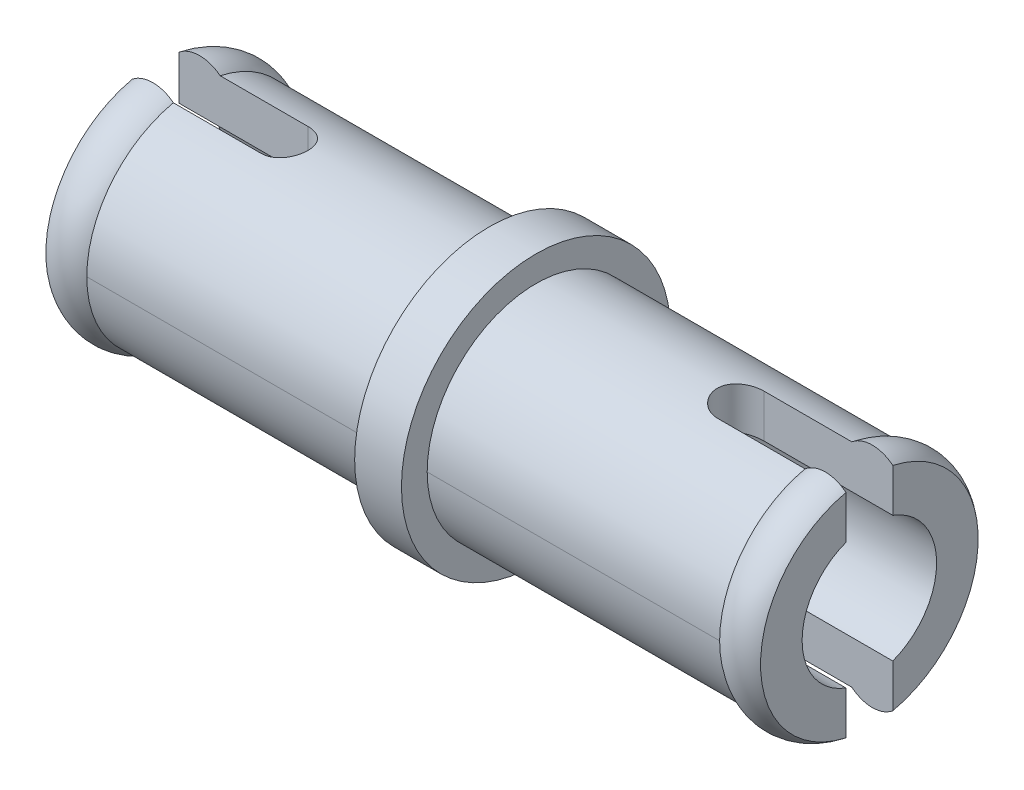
ISO-10303-21;
HEADER;
FILE_DESCRIPTION(('STEP AP214'),'2;1');
FILE_NAME('part.step','',(''),(''),'','','');
FILE_SCHEMA(('AUTOMOTIVE_DESIGN { 1 0 10303 214 1 1 1 1 }'));
ENDSEC;
DATA;
#1=APPLICATION_CONTEXT('core data for automotive mechanical design processes');
#2=APPLICATION_PROTOCOL_DEFINITION('international standard','automotive_design',2000,#1);
#3=PRODUCT_CONTEXT('',#1,'mechanical');
#4=PRODUCT('Part','Part','',(#3));
#5=PRODUCT_RELATED_PRODUCT_CATEGORY('part','',(#4));
#6=PRODUCT_DEFINITION_FORMATION('','',#4);
#7=PRODUCT_DEFINITION_CONTEXT('part definition',#1,'design');
#8=PRODUCT_DEFINITION('design','',#6,#7);
#9=PRODUCT_DEFINITION_SHAPE('','',#8);
#10=(LENGTH_UNIT() NAMED_UNIT(*) SI_UNIT(.MILLI.,.METRE.));
#11=(NAMED_UNIT(*) PLANE_ANGLE_UNIT() SI_UNIT($,.RADIAN.));
#12=(NAMED_UNIT(*) SI_UNIT($,.STERADIAN.) SOLID_ANGLE_UNIT());
#13=UNCERTAINTY_MEASURE_WITH_UNIT(LENGTH_MEASURE(1.E-05),#10,'distance_accuracy_value','');
#14=(GEOMETRIC_REPRESENTATION_CONTEXT(3) GLOBAL_UNCERTAINTY_ASSIGNED_CONTEXT((#13)) GLOBAL_UNIT_ASSIGNED_CONTEXT((#10,
#11,#12)) REPRESENTATION_CONTEXT('',''));
#15=CARTESIAN_POINT('',(0.,0.,0.));
#16=DIRECTION('',(0.,0.,1.));
#17=DIRECTION('',(1.,0.,0.));
#18=AXIS2_PLACEMENT_3D('',#15,#16,#17);
#19=CARTESIAN_POINT('',(6.7945,0.,0.));
#20=DIRECTION('',(-1.,0.,0.));
#21=DIRECTION('',(0.,0.,1.));
#22=AXIS2_PLACEMENT_3D('',#19,#20,#21);
#23=TOROIDAL_SURFACE('',#22,1.81557083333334,0.704545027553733);
#24=CARTESIAN_POINT('',(6.35,0.,0.));
#25=DIRECTION('',(-1.,0.,0.));
#26=DIRECTION('',(0.,0.,1.));
#27=AXIS2_PLACEMENT_3D('',#24,#25,#26);
#28=CIRCLE('',#27,2.3622);
#29=CARTESIAN_POINT('',(6.35,-2.30692974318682,0.507999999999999));
#30=VERTEX_POINT('',#29);
#31=CARTESIAN_POINT('',(6.35,0.,2.3622));
#32=VERTEX_POINT('',#31);
#33=EDGE_CURVE('E377',#30,#32,#28,.T.);
#34=ORIENTED_EDGE('',*,*,#33,.F.);
#35=CARTESIAN_POINT('',(6.47741005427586,-2.39136505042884,0.507999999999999));
#36=CARTESIAN_POINT('',(6.51197334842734,-2.40917149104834,0.507999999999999));
#37=CARTESIAN_POINT('',(6.54805453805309,-2.42409133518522,0.507999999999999));
#38=CARTESIAN_POINT('',(6.62223756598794,-2.44767887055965,0.507999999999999));
#39=CARTESIAN_POINT('',(6.66034158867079,-2.45633964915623,0.507999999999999));
#40=CARTESIAN_POINT('',(6.73745899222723,-2.46712246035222,0.507999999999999));
#41=CARTESIAN_POINT('',(6.77647216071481,-2.4692460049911,0.507999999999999));
#42=CARTESIAN_POINT('',(6.85428862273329,-2.46689021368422,0.507999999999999));
#43=CARTESIAN_POINT('',(6.89309196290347,-2.46241241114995,0.507999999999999));
#44=CARTESIAN_POINT('',(6.96928559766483,-2.44701820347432,0.507999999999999));
#45=CARTESIAN_POINT('',(7.00667953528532,-2.43611981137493,0.507999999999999));
#46=CARTESIAN_POINT('',(7.07912217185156,-2.40823256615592,0.507999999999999));
#47=CARTESIAN_POINT('',(7.1141707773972,-2.39124347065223,0.507999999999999));
#48=CARTESIAN_POINT('',(7.18114607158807,-2.35157896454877,0.507999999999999));
#49=CARTESIAN_POINT('',(7.21305454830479,-2.32887282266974,0.507999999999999));
#50=CARTESIAN_POINT('',(7.27267824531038,-2.27850097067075,0.507999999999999));
#51=CARTESIAN_POINT('',(7.30039323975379,-2.25083499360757,0.507999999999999));
#52=CARTESIAN_POINT('',(7.35131847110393,-2.19088754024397,0.507999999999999));
#53=CARTESIAN_POINT('',(7.37445249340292,-2.15854135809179,0.507999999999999));
#54=CARTESIAN_POINT('',(7.4151137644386,-2.09050188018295,0.507999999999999));
#55=CARTESIAN_POINT('',(7.43264045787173,-2.05480825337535,0.507999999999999));
#56=CARTESIAN_POINT('',(7.46207530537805,-1.98014136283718,0.507999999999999));
#57=CARTESIAN_POINT('',(7.47383182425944,-1.94110836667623,0.507999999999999));
#58=CARTESIAN_POINT('',(7.49085203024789,-1.86165420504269,0.507999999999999));
#59=CARTESIAN_POINT('',(7.49611473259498,-1.82123282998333,0.507999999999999));
#60=CARTESIAN_POINT('',(7.50018740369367,-1.73873823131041,0.507999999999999));
#61=CARTESIAN_POINT('',(7.49878012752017,-1.6966543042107,0.507999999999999));
#62=CARTESIAN_POINT('',(7.48916378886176,-1.61327167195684,0.507999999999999));
#63=CARTESIAN_POINT('',(7.48095347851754,-1.57197311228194,0.507999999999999));
#64=CARTESIAN_POINT('',(7.45763622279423,-1.48985387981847,0.507999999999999));
#65=CARTESIAN_POINT('',(7.44230509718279,-1.44909677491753,0.507999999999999));
#66=CARTESIAN_POINT('',(7.40513300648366,-1.37065794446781,0.507999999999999));
#67=CARTESIAN_POINT('',(7.38329048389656,-1.33297695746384,0.507999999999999));
#68=CARTESIAN_POINT('',(7.33322813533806,-1.2611761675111,0.507999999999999));
#69=CARTESIAN_POINT('',(7.3049090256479,-1.22712538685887,0.507999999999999));
#70=CARTESIAN_POINT('',(7.24276891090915,-1.16445103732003,0.507999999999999));
#71=CARTESIAN_POINT('',(7.20894785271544,-1.13582752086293,0.507999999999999));
#72=CARTESIAN_POINT('',(7.1379056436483,-1.08610665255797,0.507999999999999));
#73=CARTESIAN_POINT('',(7.10084547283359,-1.06478042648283,0.507999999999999));
#74=CARTESIAN_POINT('',(7.02339313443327,-1.02944090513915,0.507999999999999));
#75=CARTESIAN_POINT('',(6.98300442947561,-1.01542011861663,0.507999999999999));
#76=CARTESIAN_POINT('',(6.90431511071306,-0.996593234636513,0.507999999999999));
#77=CARTESIAN_POINT('',(6.86619840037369,-0.991018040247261,0.507999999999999));
#78=CARTESIAN_POINT('',(6.78959506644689,-0.98693523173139,0.507999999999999));
#79=CARTESIAN_POINT('',(6.75110863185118,-0.988424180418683,0.507999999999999));
#80=CARTESIAN_POINT('',(6.67794009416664,-0.997980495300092,0.507999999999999));
#81=CARTESIAN_POINT('',(6.64319021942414,-1.00554245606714,0.507999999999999));
#82=CARTESIAN_POINT('',(6.57538080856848,-1.02619850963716,0.507999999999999));
#83=CARTESIAN_POINT('',(6.54232159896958,-1.03929366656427,0.507999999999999));
#84=CARTESIAN_POINT('',(6.47752190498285,-1.07097484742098,0.507999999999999));
#85=CARTESIAN_POINT('',(6.44586781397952,-1.08973668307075,0.507999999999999));
#86=CARTESIAN_POINT('',(6.3857799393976,-1.13184705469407,0.507999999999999));
#87=CARTESIAN_POINT('',(6.35734729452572,-1.15519720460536,0.507999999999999));
#88=CARTESIAN_POINT('',(6.30155391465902,-1.20830245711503,0.507999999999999));
#89=CARTESIAN_POINT('',(6.27457880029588,-1.23846301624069,0.507999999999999));
#90=CARTESIAN_POINT('',(6.22564236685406,-1.30261118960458,0.507999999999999));
#91=CARTESIAN_POINT('',(6.20368295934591,-1.33660025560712,0.507999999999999));
#92=CARTESIAN_POINT('',(6.16380118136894,-1.41020792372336,0.507999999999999));
#93=CARTESIAN_POINT('',(6.14630339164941,-1.45005742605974,0.507999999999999));
#94=CARTESIAN_POINT('',(6.11812135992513,-1.53210137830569,0.507999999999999));
#95=CARTESIAN_POINT('',(6.10743802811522,-1.57429614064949,0.507999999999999));
#96=CARTESIAN_POINT('',(6.09314362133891,-1.66056768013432,0.507999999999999));
#97=CARTESIAN_POINT('',(6.08964798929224,-1.70466373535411,0.507999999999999));
#98=CARTESIAN_POINT('',(6.09030416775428,-1.79280128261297,0.507999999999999));
#99=CARTESIAN_POINT('',(6.09445490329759,-1.83684278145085,0.507999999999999));
#100=CARTESIAN_POINT('',(6.11022260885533,-1.92245920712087,0.507999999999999));
#101=CARTESIAN_POINT('',(6.12165467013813,-1.96406810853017,0.507999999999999));
#102=CARTESIAN_POINT('',(6.15160473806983,-2.04466913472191,0.507999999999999));
#103=CARTESIAN_POINT('',(6.17012325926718,-2.08366106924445,0.507999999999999));
#104=CARTESIAN_POINT('',(6.21300851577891,-2.15643870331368,0.507999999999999));
#105=CARTESIAN_POINT('',(6.23714676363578,-2.19035924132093,0.507999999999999));
#106=CARTESIAN_POINT('',(6.29092705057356,-2.25346264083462,0.507999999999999));
#107=CARTESIAN_POINT('',(6.3205608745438,-2.28265245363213,0.507999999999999));
#108=CARTESIAN_POINT('',(6.3717760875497,-2.3249040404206,0.507999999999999));
#109=CARTESIAN_POINT('',(6.3918943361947,-2.33977288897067,0.507999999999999));
#110=CARTESIAN_POINT('',(6.43360269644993,-2.36728039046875,0.507999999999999));
#111=CARTESIAN_POINT('',(6.45519278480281,-2.37991907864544,0.507999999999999));
#112=CARTESIAN_POINT('',(6.47741005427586,-2.39136505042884,0.507999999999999));
#113=B_SPLINE_CURVE_WITH_KNOTS('',3,(#35,#36,#37,#38,#39,#40,#41,#42,#43,#44,#45,#46,#47,#48,
#49,#50,#51,#52,#53,#54,#55,#56,#57,#58,#59,#60,#61,#62,#63,#64,#65,#66,#67,#68,#69,#70,#71,#72,
#73,#74,#75,#76,#77,#78,#79,#80,#81,#82,#83,#84,#85,#86,#87,#88,#89,#90,#91,#92,#93,#94,#95,#96,
#97,#98,#99,#100,#101,#102,#103,#104,#105,#106,#107,#108,#109,#110,#111,#112),.UNSPECIFIED.,.T.,
.F.,(4,2,2,2,2,2,2,2,2,2,2,2,2,2,2,2,2,2,2,2,2,2,2,2,2,2,2,2,2,2,2,2,2,2,2,2,2,2,4),(0.,
0.116550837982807,0.23323020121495,0.349882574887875,0.466507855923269,0.582807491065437,
0.699111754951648,0.816055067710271,0.933004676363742,1.05176116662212,1.17052941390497,
1.29227084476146,1.4140307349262,1.53978315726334,1.66555865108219,1.79559435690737,
1.92566119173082,2.0578742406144,2.19008856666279,2.31766288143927,2.44510611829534,
2.56004586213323,2.67492968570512,2.78113560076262,2.88736195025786,2.9972986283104,
3.10727404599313,3.22815069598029,3.34907333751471,3.4790368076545,3.60901763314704,
3.74107029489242,3.8731043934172,4.00191235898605,4.13072967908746,4.2550183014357,
4.37912260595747,4.45404261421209,4.52896143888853),.UNSPECIFIED.);
#114=CARTESIAN_POINT('',(7.239,-2.30692974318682,0.507999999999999));
#115=VERTEX_POINT('',#114);
#116=EDGE_CURVE('E261',#30,#115,#113,.T.);
#117=ORIENTED_EDGE('',*,*,#116,.T.);
#118=CARTESIAN_POINT('',(7.239,0.,0.));
#119=DIRECTION('',(1.,0.,0.));
#120=DIRECTION('',(0.,0.,-1.));
#121=AXIS2_PLACEMENT_3D('',#118,#119,#120);
#122=CIRCLE('',#121,2.3622);
#123=CARTESIAN_POINT('',(7.239,2.30692974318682,0.507999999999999));
#124=VERTEX_POINT('',#123);
#125=EDGE_CURVE('E429',#124,#115,#122,.T.);
#126=ORIENTED_EDGE('',*,*,#125,.F.);
#127=CARTESIAN_POINT('',(6.59752514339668,1.01957455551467,0.507999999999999));
#128=CARTESIAN_POINT('',(6.63149599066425,1.00852436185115,0.507999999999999));
#129=CARTESIAN_POINT('',(6.66638658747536,1.00024995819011,0.507999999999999));
#130=CARTESIAN_POINT('',(6.73707589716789,0.989707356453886,0.507999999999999));
#131=CARTESIAN_POINT('',(6.77287480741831,0.987440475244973,0.507999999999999));
#132=CARTESIAN_POINT('',(6.84433685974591,0.989049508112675,0.507999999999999));
#133=CARTESIAN_POINT('',(6.87999999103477,0.992925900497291,0.507999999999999));
#134=CARTESIAN_POINT('',(6.95016789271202,1.00659636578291,0.507999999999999));
#135=CARTESIAN_POINT('',(6.98467246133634,1.01639146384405,0.507999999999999));
#136=CARTESIAN_POINT('',(7.05179742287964,1.04145105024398,0.507999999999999));
#137=CARTESIAN_POINT('',(7.08440857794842,1.05674010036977,0.507999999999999));
#138=CARTESIAN_POINT('',(7.14689495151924,1.09213523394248,0.507999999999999));
#139=CARTESIAN_POINT('',(7.1767693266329,1.11224279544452,0.507999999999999));
#140=CARTESIAN_POINT('',(7.23578176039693,1.15859935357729,0.507999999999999));
#141=CARTESIAN_POINT('',(7.26461430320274,1.18523707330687,0.507999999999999));
#142=CARTESIAN_POINT('',(7.31785711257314,1.24261574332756,0.507999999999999));
#143=CARTESIAN_POINT('',(7.34226558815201,1.27335834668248,0.507999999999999));
#144=CARTESIAN_POINT('',(7.38816120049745,1.34105499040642,0.507999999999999));
#145=CARTESIAN_POINT('',(7.40919317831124,1.3783185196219,0.507999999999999));
#146=CARTESIAN_POINT('',(7.44494663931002,1.45576314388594,0.507999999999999));
#147=CARTESIAN_POINT('',(7.45966672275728,1.49594488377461,0.507999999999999));
#148=CARTESIAN_POINT('',(7.48275683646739,1.57957359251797,0.507999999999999));
#149=CARTESIAN_POINT('',(7.49089448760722,1.62308508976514,0.507999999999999));
#150=CARTESIAN_POINT('',(7.49963010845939,1.71086276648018,0.507999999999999));
#151=CARTESIAN_POINT('',(7.50022839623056,1.75512891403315,0.507999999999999));
#152=CARTESIAN_POINT('',(7.493783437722,1.8424290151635,0.507999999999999));
#153=CARTESIAN_POINT('',(7.48685641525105,1.88547146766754,0.507999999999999));
#154=CARTESIAN_POINT('',(7.46561077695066,1.96969502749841,0.507999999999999));
#155=CARTESIAN_POINT('',(7.45129349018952,2.01087646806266,0.507999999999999));
#156=CARTESIAN_POINT('',(7.41620260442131,2.08868234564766,0.507999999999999));
#157=CARTESIAN_POINT('',(7.39566910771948,2.12541505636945,0.507999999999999));
#158=CARTESIAN_POINT('',(7.34852416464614,2.19474976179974,0.507999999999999));
#159=CARTESIAN_POINT('',(7.32191389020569,2.22735255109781,0.507999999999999));
#160=CARTESIAN_POINT('',(7.26434085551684,2.28635482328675,0.507999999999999));
#161=CARTESIAN_POINT('',(7.2335529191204,2.31292497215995,0.507999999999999));
#162=CARTESIAN_POINT('',(7.16785857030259,2.36036291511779,0.507999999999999));
#163=CARTESIAN_POINT('',(7.13295276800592,2.38123155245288,0.507999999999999));
#164=CARTESIAN_POINT('',(7.06094159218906,2.41615510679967,0.507999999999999));
#165=CARTESIAN_POINT('',(7.02391101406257,2.43036436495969,0.507999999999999));
#166=CARTESIAN_POINT('',(6.94797028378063,2.45226444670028,0.507999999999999));
#167=CARTESIAN_POINT('',(6.90906030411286,2.45995586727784,0.507999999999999));
#168=CARTESIAN_POINT('',(6.83105099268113,2.46851576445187,0.507999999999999));
#169=CARTESIAN_POINT('',(6.79196196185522,2.46947837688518,0.507999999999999));
#170=CARTESIAN_POINT('',(6.71418206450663,2.46480053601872,0.507999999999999));
#171=CARTESIAN_POINT('',(6.67549118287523,2.45916033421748,0.507999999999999));
#172=CARTESIAN_POINT('',(6.59975066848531,2.44148513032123,0.507999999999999));
#173=CARTESIAN_POINT('',(6.56269553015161,2.42947368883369,0.507999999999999));
#174=CARTESIAN_POINT('',(6.49110983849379,2.39943836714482,0.507999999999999));
#175=CARTESIAN_POINT('',(6.45657931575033,2.38141441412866,0.507999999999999));
#176=CARTESIAN_POINT('',(6.39077302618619,2.33976346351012,0.507999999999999));
#177=CARTESIAN_POINT('',(6.35951949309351,2.31610136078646,0.507999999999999));
#178=CARTESIAN_POINT('',(6.30135035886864,2.26394312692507,0.507999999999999));
#179=CARTESIAN_POINT('',(6.27443500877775,2.2354467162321,0.507999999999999));
#180=CARTESIAN_POINT('',(6.22521898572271,2.1739466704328,0.507999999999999));
#181=CARTESIAN_POINT('',(6.20300080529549,2.14087705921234,0.507999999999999));
#182=CARTESIAN_POINT('',(6.16427214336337,2.07155253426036,0.507999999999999));
#183=CARTESIAN_POINT('',(6.14776227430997,2.03529727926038,0.507999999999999));
#184=CARTESIAN_POINT('',(6.12044682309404,1.95963849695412,0.507999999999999));
#185=CARTESIAN_POINT('',(6.10979961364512,1.92017783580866,0.507999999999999));
#186=CARTESIAN_POINT('',(6.09504921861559,1.84005436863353,0.507999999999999));
#187=CARTESIAN_POINT('',(6.09094705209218,1.7993913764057,0.507999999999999));
#188=CARTESIAN_POINT('',(6.08925416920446,1.71657634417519,0.507999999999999));
#189=CARTESIAN_POINT('',(6.09188476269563,1.67441979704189,0.507999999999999));
#190=CARTESIAN_POINT('',(6.10394660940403,1.59109313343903,0.507999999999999));
#191=CARTESIAN_POINT('',(6.11337886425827,1.54992316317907,0.507999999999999));
#192=CARTESIAN_POINT('',(6.13914566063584,1.46829360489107,0.507999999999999));
#193=CARTESIAN_POINT('',(6.15569894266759,1.42790297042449,0.507999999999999));
#194=CARTESIAN_POINT('',(6.19526329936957,1.35039238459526,0.507999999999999));
#195=CARTESIAN_POINT('',(6.2182776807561,1.31327412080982,0.507999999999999));
#196=CARTESIAN_POINT('',(6.27055903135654,1.24291437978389,0.507999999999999));
#197=CARTESIAN_POINT('',(6.29990917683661,1.20973458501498,0.507999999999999));
#198=CARTESIAN_POINT('',(6.36395184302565,1.14904898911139,0.507999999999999));
#199=CARTESIAN_POINT('',(6.39863667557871,1.12153515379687,0.507999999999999));
#200=CARTESIAN_POINT('',(6.46070664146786,1.08103376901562,0.507999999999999));
#201=CARTESIAN_POINT('',(6.48690707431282,1.06620887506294,0.507999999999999));
#202=CARTESIAN_POINT('',(6.54103013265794,1.04012689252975,0.507999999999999));
#203=CARTESIAN_POINT('',(6.56895230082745,1.02886886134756,0.507999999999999));
#204=CARTESIAN_POINT('',(6.59752514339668,1.01957455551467,0.507999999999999));
#205=B_SPLINE_CURVE_WITH_KNOTS('',3,(#127,#128,#129,#130,#131,#132,#133,#134,#135,#136,#137,
#138,#139,#140,#141,#142,#143,#144,#145,#146,#147,#148,#149,#150,#151,#152,#153,#154,#155,#156,
#157,#158,#159,#160,#161,#162,#163,#164,#165,#166,#167,#168,#169,#170,#171,#172,#173,#174,#175,
#176,#177,#178,#179,#180,#181,#182,#183,#184,#185,#186,#187,#188,#189,#190,#191,#192,#193,#194,
#195,#196,#197,#198,#199,#200,#201,#202,#203,#204),.UNSPECIFIED.,.T.,.F.,(4,2,2,2,2,2,2,2,2,2,2,
2,2,2,2,2,2,2,2,2,2,2,2,2,2,2,2,2,2,2,2,2,2,2,2,2,2,2,4),(0.,0.107065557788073,
0.214154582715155,0.321251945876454,0.428367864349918,0.535968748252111,0.643602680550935,
0.760875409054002,0.878195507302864,1.0059864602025,1.13380573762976,1.26596149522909,
1.39811167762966,1.52824952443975,1.65836397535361,1.78398391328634,1.90957964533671,
2.03098528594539,2.15237296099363,2.2707880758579,2.3891923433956,2.50593676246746,
2.62267673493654,2.73898798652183,2.85530064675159,2.97235735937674,3.08942084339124,
3.20839506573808,3.32738204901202,3.44944275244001,3.5715224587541,3.69766615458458,
3.82382843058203,3.95417891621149,4.08459623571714,4.21684290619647,4.34890074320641,
4.43897729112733,4.52903001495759),.UNSPECIFIED.);
#206=CARTESIAN_POINT('',(6.35,2.30692974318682,0.507999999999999));
#207=VERTEX_POINT('',#206);
#208=EDGE_CURVE('E237',#124,#207,#205,.T.);
#209=ORIENTED_EDGE('',*,*,#208,.T.);
#210=EDGE_CURVE('E381',#32,#207,#28,.T.);
#211=ORIENTED_EDGE('',*,*,#210,.F.);
#212=EDGE_LOOP('',(#34,#117,#126,#209,#211));
#213=FACE_BOUND('',#212,.T.);
#214=ADVANCED_FACE('F34',(#213),#23,.T.);
#215=CARTESIAN_POINT('',(7.239,0.,0.));
#216=DIRECTION('',(1.,0.,0.));
#217=DIRECTION('',(0.,0.,-1.));
#218=AXIS2_PLACEMENT_3D('',#215,#216,#217);
#219=PLANE('',#218);
#220=DIRECTION('',(0.,-1.,0.));
#221=VECTOR('',#220,1.);
#222=CARTESIAN_POINT('',(7.239,0.,0.507999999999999));
#223=LINE('',#222,#221);
#224=CARTESIAN_POINT('',(7.239,1.36930502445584,0.507999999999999));
#225=VERTEX_POINT('',#224);
#226=EDGE_CURVE('E47',#124,#225,#223,.T.);
#227=ORIENTED_EDGE('',*,*,#226,.F.);
#228=ORIENTED_EDGE('',*,*,#125,.T.);
#229=CARTESIAN_POINT('',(7.239,-1.36930502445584,0.507999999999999));
#230=VERTEX_POINT('',#229);
#231=EDGE_CURVE('E480',#230,#115,#223,.T.);
#232=ORIENTED_EDGE('',*,*,#231,.F.);
#233=CARTESIAN_POINT('',(7.239,0.,0.));
#234=DIRECTION('',(-1.,0.,0.));
#235=DIRECTION('',(0.,0.,1.));
#236=AXIS2_PLACEMENT_3D('',#233,#234,#235);
#237=CIRCLE('',#236,1.4605);
#238=EDGE_CURVE('E387',#230,#225,#237,.T.);
#239=ORIENTED_EDGE('',*,*,#238,.T.);
#240=EDGE_LOOP('',(#227,#228,#232,#239));
#241=FACE_BOUND('',#240,.T.);
#242=ADVANCED_FACE('F343',(#241),#219,.T.);
#243=CARTESIAN_POINT('',(-8.255,0.,0.));
#244=DIRECTION('',(1.,0.,0.));
#245=DIRECTION('',(0.,0.,-1.));
#246=AXIS2_PLACEMENT_3D('',#243,#244,#245);
#247=CYLINDRICAL_SURFACE('',#246,2.3876);
#248=DIRECTION('',(1.,0.,0.));
#249=VECTOR('',#248,1.);
#250=CARTESIAN_POINT('',(-8.255,-2.33293158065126,-0.508000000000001));
#251=LINE('',#250,#249);
#252=CARTESIAN_POINT('',(-7.36599999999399,-2.33293158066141,-0.508000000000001));
#253=VERTEX_POINT('',#252);
#254=CARTESIAN_POINT('',(-5.461,-2.33293158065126,-0.508000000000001));
#255=VERTEX_POINT('',#254);
#256=EDGE_CURVE('E491',#253,#255,#251,.T.);
#257=ORIENTED_EDGE('',*,*,#256,.F.);
#258=CARTESIAN_POINT('',(-7.366,0.,0.));
#259=DIRECTION('',(1.,0.,0.));
#260=DIRECTION('',(0.,0.,-1.));
#261=AXIS2_PLACEMENT_3D('',#258,#259,#260);
#262=CIRCLE('',#261,2.3876);
#263=CARTESIAN_POINT('',(-7.366,0.,-2.3876));
#264=VERTEX_POINT('',#263);
#265=EDGE_CURVE('E390',#253,#264,#262,.T.);
#266=ORIENTED_EDGE('',*,*,#265,.T.);
#267=DIRECTION('',(1.,0.,0.));
#268=VECTOR('',#267,1.);
#269=CARTESIAN_POINT('',(-8.255,0.,-2.3876));
#270=LINE('',#269,#268);
#271=CARTESIAN_POINT('',(-1.016,0.,-2.3876));
#272=VERTEX_POINT('',#271);
#273=EDGE_CURVE('E439',#264,#272,#270,.T.);
#274=ORIENTED_EDGE('',*,*,#273,.T.);
#275=CARTESIAN_POINT('',(-1.016,0.,0.));
#276=DIRECTION('',(-1.,0.,0.));
#277=DIRECTION('',(0.,0.,1.));
#278=AXIS2_PLACEMENT_3D('',#275,#276,#277);
#279=CIRCLE('',#278,2.3876);
#280=CARTESIAN_POINT('',(-1.016,0.,2.3876));
#281=VERTEX_POINT('',#280);
#282=EDGE_CURVE('E402',#272,#281,#279,.T.);
#283=ORIENTED_EDGE('',*,*,#282,.T.);
#284=DIRECTION('',(-1.,0.,0.));
#285=VECTOR('',#284,1.);
#286=CARTESIAN_POINT('',(-8.255,0.,2.3876));
#287=LINE('',#286,#285);
#288=CARTESIAN_POINT('',(-7.366,0.,2.3876));
#289=VERTEX_POINT('',#288);
#290=EDGE_CURVE('E436',#281,#289,#287,.T.);
#291=ORIENTED_EDGE('',*,*,#290,.T.);
#292=CARTESIAN_POINT('',(-7.36599999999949,-2.33293158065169,0.507999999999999));
#293=VERTEX_POINT('',#292);
#294=EDGE_CURVE('E393',#289,#293,#262,.T.);
#295=ORIENTED_EDGE('',*,*,#294,.T.);
#296=DIRECTION('',(1.,0.,0.));
#297=VECTOR('',#296,1.);
#298=CARTESIAN_POINT('',(-8.255,-2.33293158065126,0.507999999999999));
#299=LINE('',#298,#297);
#300=CARTESIAN_POINT('',(-5.461,-2.33293158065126,0.508));
#301=VERTEX_POINT('',#300);
#302=EDGE_CURVE('E331',#301,#293,#299,.F.);
#303=ORIENTED_EDGE('',*,*,#302,.F.);
#304=CARTESIAN_POINT('',(-5.461,-2.33293158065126,-0.508000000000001));
#305=CARTESIAN_POINT('',(-5.43276432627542,-2.33291136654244,-0.508025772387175));
#306=CARTESIAN_POINT('',(-5.40454333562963,-2.33344365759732,-0.505647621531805));
#307=CARTESIAN_POINT('',(-5.34895811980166,-2.33546100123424,-0.496282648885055));
#308=CARTESIAN_POINT('',(-5.32159253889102,-2.33694445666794,-0.48930355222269));
#309=CARTESIAN_POINT('',(-5.26844407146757,-2.3407129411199,-0.470934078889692));
#310=CARTESIAN_POINT('',(-5.24266128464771,-2.34299802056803,-0.459543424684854));
#311=CARTESIAN_POINT('',(-5.19336676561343,-2.34810502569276,-0.432693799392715));
#312=CARTESIAN_POINT('',(-5.16985535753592,-2.35092702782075,-0.417234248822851));
#313=CARTESIAN_POINT('',(-5.12540373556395,-2.35684134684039,-0.382423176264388));
#314=CARTESIAN_POINT('',(-5.10450486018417,-2.35993693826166,-0.363019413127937));
#315=CARTESIAN_POINT('',(-5.06623091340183,-2.36602084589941,-0.320982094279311));
#316=CARTESIAN_POINT('',(-5.04885639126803,-2.36900914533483,-0.29834803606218));
#317=CARTESIAN_POINT('',(-5.01796285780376,-2.37457737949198,-0.250215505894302));
#318=CARTESIAN_POINT('',(-5.00448375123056,-2.37715297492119,-0.224690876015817));
#319=CARTESIAN_POINT('',(-4.9820222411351,-2.38156829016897,-0.171676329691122));
#320=CARTESIAN_POINT('',(-4.97303912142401,-2.3834081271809,-0.144186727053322));
#321=CARTESIAN_POINT('',(-4.95995412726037,-2.38612155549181,-0.0884542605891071));
#322=CARTESIAN_POINT('',(-4.95578179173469,-2.38700908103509,-0.0602286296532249));
#323=CARTESIAN_POINT('',(-4.9522166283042,-2.38776612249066,-0.00346435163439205));
#324=CARTESIAN_POINT('',(-4.95282339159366,-2.3876357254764,0.0250742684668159));
#325=CARTESIAN_POINT('',(-4.9587465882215,-2.38638227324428,0.081167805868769));
#326=CARTESIAN_POINT('',(-4.96398697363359,-2.38527524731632,0.108731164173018));
#327=CARTESIAN_POINT('',(-4.97890761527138,-2.38221113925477,0.162577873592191));
#328=CARTESIAN_POINT('',(-4.98858803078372,-2.38025402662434,0.188861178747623));
#329=CARTESIAN_POINT('',(-5.01218239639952,-2.37568362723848,0.239615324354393));
#330=CARTESIAN_POINT('',(-5.02612555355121,-2.3730658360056,0.264072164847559));
#331=CARTESIAN_POINT('',(-5.05782751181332,-2.36746174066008,0.310326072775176));
#332=CARTESIAN_POINT('',(-5.07558669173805,-2.36447539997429,0.332122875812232));
#333=CARTESIAN_POINT('',(-5.11482905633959,-2.3583939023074,0.372888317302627));
#334=CARTESIAN_POINT('',(-5.13637837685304,-2.35529775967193,0.391793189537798));
#335=CARTESIAN_POINT('',(-5.18238011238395,-2.34939982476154,0.425737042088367));
#336=CARTESIAN_POINT('',(-5.20683332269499,-2.34659811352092,0.44077495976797));
#337=CARTESIAN_POINT('',(-5.25805171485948,-2.34160336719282,0.466584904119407));
#338=CARTESIAN_POINT('',(-5.28482410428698,-2.33941232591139,0.477343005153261));
#339=CARTESIAN_POINT('',(-5.33983722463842,-2.33591539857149,0.494174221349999));
#340=CARTESIAN_POINT('',(-5.36807570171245,-2.33460819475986,0.500254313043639));
#341=CARTESIAN_POINT('',(-5.40728714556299,-2.33352507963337,0.505267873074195));
#342=CARTESIAN_POINT('',(-5.41801220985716,-2.33330278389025,0.506292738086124));
#343=CARTESIAN_POINT('',(-5.43948988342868,-2.33300614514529,0.507657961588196));
#344=CARTESIAN_POINT('',(-5.45024241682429,-2.33293155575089,0.50799946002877));
#345=CARTESIAN_POINT('',(-5.461,-2.33293158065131,0.508000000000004));
#346=B_SPLINE_CURVE_WITH_KNOTS('',3,(#304,#305,#306,#307,#308,#309,#310,#311,#312,#313,#314,
#315,#316,#317,#318,#319,#320,#321,#322,#323,#324,#325,#326,#327,#328,#329,#330,#331,#332,#333,
#334,#335,#336,#337,#338,#339,#340,#341,#342,#343,#344,#345),.UNSPECIFIED.,.F.,.F.,(4,2,2,2,2,2,
2,2,2,2,2,2,2,2,2,2,2,2,2,2,4),(0.,0.08457969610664,0.169017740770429,0.253461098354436,
0.337916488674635,0.423573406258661,0.509243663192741,0.595762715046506,0.682267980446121,
0.767489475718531,0.852703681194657,0.936544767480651,1.02038886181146,1.1048208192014,
1.18926116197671,1.27535563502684,1.36147374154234,1.44786981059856,1.534136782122,
1.56644773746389,1.59870474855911),.UNSPECIFIED.);
#347=EDGE_CURVE('E330',#255,#301,#346,.T.);
#348=ORIENTED_EDGE('',*,*,#347,.F.);
#349=EDGE_LOOP('',(#257,#266,#274,#283,#291,#295,#303,#348));
#350=FACE_BOUND('',#349,.T.);
#351=ADVANCED_FACE('F337',(#350),#247,.T.);
#352=DIRECTION('',(1.,0.,0.));
#353=VECTOR('',#352,1.);
#354=CARTESIAN_POINT('',(-8.255,2.33293158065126,-0.508000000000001));
#355=LINE('',#354,#353);
#356=CARTESIAN_POINT('',(-5.461,2.33293158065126,-0.508000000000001));
#357=VERTEX_POINT('',#356);
#358=CARTESIAN_POINT('',(-7.366,2.33293158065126,-0.508000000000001));
#359=VERTEX_POINT('',#358);
#360=EDGE_CURVE('E497',#357,#359,#355,.F.);
#361=ORIENTED_EDGE('',*,*,#360,.F.);
#362=CARTESIAN_POINT('',(-5.461,2.33293158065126,0.508));
#363=CARTESIAN_POINT('',(-5.43276432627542,2.33291136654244,0.508025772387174));
#364=CARTESIAN_POINT('',(-5.40454333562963,2.33344365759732,0.505647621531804));
#365=CARTESIAN_POINT('',(-5.34895811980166,2.33546100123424,0.496282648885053));
#366=CARTESIAN_POINT('',(-5.32159253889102,2.33694445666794,0.489303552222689));
#367=CARTESIAN_POINT('',(-5.26844407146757,2.3407129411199,0.470934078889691));
#368=CARTESIAN_POINT('',(-5.24266128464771,2.34299802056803,0.459543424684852));
#369=CARTESIAN_POINT('',(-5.19336676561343,2.34810502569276,0.432693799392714));
#370=CARTESIAN_POINT('',(-5.16985535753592,2.35092702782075,0.41723424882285));
#371=CARTESIAN_POINT('',(-5.12540373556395,2.35684134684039,0.382423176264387));
#372=CARTESIAN_POINT('',(-5.10450486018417,2.35993693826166,0.363019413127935));
#373=CARTESIAN_POINT('',(-5.06623091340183,2.36602084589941,0.32098209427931));
#374=CARTESIAN_POINT('',(-5.04885639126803,2.36900914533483,0.298348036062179));
#375=CARTESIAN_POINT('',(-5.01796285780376,2.37457737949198,0.2502155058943));
#376=CARTESIAN_POINT('',(-5.00448375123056,2.37715297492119,0.224690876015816));
#377=CARTESIAN_POINT('',(-4.9820222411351,2.38156829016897,0.171676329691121));
#378=CARTESIAN_POINT('',(-4.97303912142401,2.3834081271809,0.144186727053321));
#379=CARTESIAN_POINT('',(-4.95995412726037,2.38612155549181,0.0884542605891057));
#380=CARTESIAN_POINT('',(-4.95578179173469,2.38700908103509,0.0602286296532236));
#381=CARTESIAN_POINT('',(-4.9522166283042,2.38776612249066,0.00346435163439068));
#382=CARTESIAN_POINT('',(-4.95282339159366,2.3876357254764,-0.0250742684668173));
#383=CARTESIAN_POINT('',(-4.9587465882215,2.38638227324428,-0.0811678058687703));
#384=CARTESIAN_POINT('',(-4.96398697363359,2.38527524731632,-0.108731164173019));
#385=CARTESIAN_POINT('',(-4.97890761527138,2.38221113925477,-0.162577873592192));
#386=CARTESIAN_POINT('',(-4.98858803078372,2.38025402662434,-0.188861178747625));
#387=CARTESIAN_POINT('',(-5.01218239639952,2.37568362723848,-0.239615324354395));
#388=CARTESIAN_POINT('',(-5.02612555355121,2.3730658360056,-0.264072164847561));
#389=CARTESIAN_POINT('',(-5.05782751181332,2.36746174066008,-0.310326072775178));
#390=CARTESIAN_POINT('',(-5.07558669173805,2.36447539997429,-0.332122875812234));
#391=CARTESIAN_POINT('',(-5.11482905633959,2.3583939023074,-0.372888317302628));
#392=CARTESIAN_POINT('',(-5.13637837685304,2.35529775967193,-0.3917931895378));
#393=CARTESIAN_POINT('',(-5.18238011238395,2.34939982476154,-0.425737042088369));
#394=CARTESIAN_POINT('',(-5.20683332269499,2.34659811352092,-0.440774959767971));
#395=CARTESIAN_POINT('',(-5.25805171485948,2.34160336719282,-0.466584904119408));
#396=CARTESIAN_POINT('',(-5.28482410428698,2.33941232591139,-0.477343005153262));
#397=CARTESIAN_POINT('',(-5.33983722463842,2.33591539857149,-0.49417422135));
#398=CARTESIAN_POINT('',(-5.36807570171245,2.33460819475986,-0.500254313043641));
#399=CARTESIAN_POINT('',(-5.40728714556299,2.33352507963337,-0.505267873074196));
#400=CARTESIAN_POINT('',(-5.41801220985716,2.33330278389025,-0.506292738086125));
#401=CARTESIAN_POINT('',(-5.43948988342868,2.33300614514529,-0.507657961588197));
#402=CARTESIAN_POINT('',(-5.45024241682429,2.33293155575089,-0.507999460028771));
#403=CARTESIAN_POINT('',(-5.461,2.33293158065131,-0.508000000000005));
#404=B_SPLINE_CURVE_WITH_KNOTS('',3,(#362,#363,#364,#365,#366,#367,#368,#369,#370,#371,#372,
#373,#374,#375,#376,#377,#378,#379,#380,#381,#382,#383,#384,#385,#386,#387,#388,#389,#390,#391,
#392,#393,#394,#395,#396,#397,#398,#399,#400,#401,#402,#403),.UNSPECIFIED.,.F.,.F.,(4,2,2,2,2,2,
2,2,2,2,2,2,2,2,2,2,2,2,2,2,4),(0.,0.08457969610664,0.169017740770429,0.253461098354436,
0.337916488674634,0.423573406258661,0.509243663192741,0.595762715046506,0.682267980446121,
0.767489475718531,0.852703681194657,0.936544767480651,1.02038886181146,1.1048208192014,
1.18926116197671,1.27535563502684,1.36147374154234,1.44786981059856,1.534136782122,
1.56644773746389,1.59870474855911),.UNSPECIFIED.);
#405=CARTESIAN_POINT('',(-5.461,2.33293158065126,0.508));
#406=VERTEX_POINT('',#405);
#407=EDGE_CURVE('E324',#406,#357,#404,.T.);
#408=ORIENTED_EDGE('',*,*,#407,.F.);
#409=DIRECTION('',(1.,0.,0.));
#410=VECTOR('',#409,1.);
#411=CARTESIAN_POINT('',(-8.255,2.33293158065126,0.507999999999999));
#412=LINE('',#411,#410);
#413=CARTESIAN_POINT('',(-7.36599999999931,2.33293158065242,0.507999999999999));
#414=VERTEX_POINT('',#413);
#415=EDGE_CURVE('E758',#414,#406,#412,.T.);
#416=ORIENTED_EDGE('',*,*,#415,.F.);
#417=EDGE_CURVE('E394',#414,#289,#262,.T.);
#418=ORIENTED_EDGE('',*,*,#417,.T.);
#419=ORIENTED_EDGE('',*,*,#290,.F.);
#420=EDGE_CURVE('E406',#281,#272,#279,.T.);
#421=ORIENTED_EDGE('',*,*,#420,.T.);
#422=ORIENTED_EDGE('',*,*,#273,.F.);
#423=EDGE_CURVE('E395',#264,#359,#262,.T.);
#424=ORIENTED_EDGE('',*,*,#423,.T.);
#425=EDGE_LOOP('',(#361,#408,#416,#418,#419,#421,#422,#424));
#426=FACE_BOUND('',#425,.T.);
#427=ADVANCED_FACE('F342',(#426),#247,.T.);
#428=CARTESIAN_POINT('',(-7.8105,0.,0.));
#429=DIRECTION('',(1.,0.,0.));
#430=DIRECTION('',(0.,0.,-1.));
#431=AXIS2_PLACEMENT_3D('',#428,#429,#430);
#432=TOROIDAL_SURFACE('',#431,1.81557083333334,0.724429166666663);
#433=CARTESIAN_POINT('',(-8.12686237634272,-2.41440670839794,-0.508000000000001));
#434=CARTESIAN_POINT('',(-8.0910487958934,-2.43217082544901,-0.508000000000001));
#435=CARTESIAN_POINT('',(-8.0537190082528,-2.446942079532,-0.508000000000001));
#436=CARTESIAN_POINT('',(-7.97707995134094,-2.47002405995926,-0.508000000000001));
#437=CARTESIAN_POINT('',(-7.93776851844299,-2.47832755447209,-0.508000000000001));
#438=CARTESIAN_POINT('',(-7.85831498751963,-2.48819852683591,-0.508000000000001));
#439=CARTESIAN_POINT('',(-7.81817310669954,-2.48976774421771,-0.508000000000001));
#440=CARTESIAN_POINT('',(-7.73820884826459,-2.48612399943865,-0.508000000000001));
#441=CARTESIAN_POINT('',(-7.69838639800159,-2.48091262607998,-0.508000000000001));
#442=CARTESIAN_POINT('',(-7.62027901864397,-2.46389325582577,-0.508000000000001));
#443=CARTESIAN_POINT('',(-7.58199061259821,-2.45210120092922,-0.508000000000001));
#444=CARTESIAN_POINT('',(-7.50791978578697,-2.42229185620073,-0.508000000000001));
#445=CARTESIAN_POINT('',(-7.47213747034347,-2.40427430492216,-0.508000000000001));
#446=CARTESIAN_POINT('',(-7.40385953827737,-2.36243512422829,-0.508000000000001));
#447=CARTESIAN_POINT('',(-7.37138423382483,-2.338580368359,-0.508000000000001));
#448=CARTESIAN_POINT('',(-7.31082380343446,-2.28583420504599,-0.508000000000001));
#449=CARTESIAN_POINT('',(-7.28273891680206,-2.25694252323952,-0.508000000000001));
#450=CARTESIAN_POINT('',(-7.23127017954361,-2.19447661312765,-0.508000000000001));
#451=CARTESIAN_POINT('',(-7.20796649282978,-2.16083637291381,-0.508000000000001));
#452=CARTESIAN_POINT('',(-7.16717926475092,-2.09019893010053,-0.508000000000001));
#453=CARTESIAN_POINT('',(-7.14969629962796,-2.05320139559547,-0.508000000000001));
#454=CARTESIAN_POINT('',(-7.12055906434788,-1.97591438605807,-0.508000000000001));
#455=CARTESIAN_POINT('',(-7.10906246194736,-1.93556551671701,-0.508000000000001));
#456=CARTESIAN_POINT('',(-7.09277030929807,-1.85353960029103,-0.508000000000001));
#457=CARTESIAN_POINT('',(-7.08797578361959,-1.81186235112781,-0.508000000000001));
#458=CARTESIAN_POINT('',(-7.08504835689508,-1.72689500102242,-0.508000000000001));
#459=CARTESIAN_POINT('',(-7.08714105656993,-1.68359715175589,-0.508000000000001));
#460=CARTESIAN_POINT('',(-7.09831186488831,-1.59791307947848,-0.508000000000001));
#461=CARTESIAN_POINT('',(-7.10739126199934,-1.55552702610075,-0.508000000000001));
#462=CARTESIAN_POINT('',(-7.13264314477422,-1.47132600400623,-0.508000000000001));
#463=CARTESIAN_POINT('',(-7.14904913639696,-1.42958097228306,-0.508000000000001));
#464=CARTESIAN_POINT('',(-7.18851717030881,-1.34935461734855,-0.508000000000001));
#465=CARTESIAN_POINT('',(-7.2115809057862,-1.31087412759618,-0.508000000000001));
#466=CARTESIAN_POINT('',(-7.26423204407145,-1.2376670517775,-0.508000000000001));
#467=CARTESIAN_POINT('',(-7.29392248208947,-1.20301434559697,-0.508000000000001));
#468=CARTESIAN_POINT('',(-7.35890167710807,-1.13939625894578,-0.508000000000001));
#469=CARTESIAN_POINT('',(-7.39419046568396,-1.11043091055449,-0.508000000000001));
#470=CARTESIAN_POINT('',(-7.46809442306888,-1.06039859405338,-0.508000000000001));
#471=CARTESIAN_POINT('',(-7.5065366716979,-1.03907755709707,-0.508000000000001));
#472=CARTESIAN_POINT('',(-7.5867418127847,-1.00405562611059,-0.508000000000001));
#473=CARTESIAN_POINT('',(-7.62850093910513,-0.990346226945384,-0.508000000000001));
#474=CARTESIAN_POINT('',(-7.70950535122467,-0.972470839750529,-0.508000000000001));
#475=CARTESIAN_POINT('',(-7.74856591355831,-0.967466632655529,-0.508000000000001));
#476=CARTESIAN_POINT('',(-7.8269365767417,-0.964688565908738,-0.508000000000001));
#477=CARTESIAN_POINT('',(-7.86624655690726,-0.966911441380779,-0.508000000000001));
#478=CARTESIAN_POINT('',(-7.94087133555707,-0.97798649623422,-0.508000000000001));
#479=CARTESIAN_POINT('',(-7.97626403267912,-0.986326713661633,-0.508000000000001));
#480=CARTESIAN_POINT('',(-8.04524171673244,-1.00859073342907,-0.508000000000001));
#481=CARTESIAN_POINT('',(-8.07882630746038,-1.02251575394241,-0.508000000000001));
#482=CARTESIAN_POINT('',(-8.14483097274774,-1.05602866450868,-0.508000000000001));
#483=CARTESIAN_POINT('',(-8.17714135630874,-1.07583155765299,-0.508000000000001));
#484=CARTESIAN_POINT('',(-8.23839483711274,-1.12008951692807,-0.508000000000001));
#485=CARTESIAN_POINT('',(-8.26733668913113,-1.14454629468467,-0.508000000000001));
#486=CARTESIAN_POINT('',(-8.32418096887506,-1.20015504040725,-0.508000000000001));
#487=CARTESIAN_POINT('',(-8.35166124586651,-1.23173901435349,-0.508000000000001));
#488=CARTESIAN_POINT('',(-8.40137419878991,-1.29879993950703,-0.508000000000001));
#489=CARTESIAN_POINT('',(-8.42360486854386,-1.33427837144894,-0.508000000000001));
#490=CARTESIAN_POINT('',(-8.46376410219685,-1.41096304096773,-0.508000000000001));
#491=CARTESIAN_POINT('',(-8.48125653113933,-1.45239859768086,-0.508000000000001));
#492=CARTESIAN_POINT('',(-8.50913557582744,-1.5375996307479,-0.508000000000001));
#493=CARTESIAN_POINT('',(-8.5195213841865,-1.58136537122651,-0.508000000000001));
#494=CARTESIAN_POINT('',(-8.53288552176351,-1.67055797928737,-0.508000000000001));
#495=CARTESIAN_POINT('',(-8.53577383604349,-1.715998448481,-0.508000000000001));
#496=CARTESIAN_POINT('',(-8.5336582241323,-1.80669767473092,-0.508000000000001));
#497=CARTESIAN_POINT('',(-8.52865553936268,-1.8519564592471,-0.508000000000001));
#498=CARTESIAN_POINT('',(-8.51100540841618,-1.93968909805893,-0.508000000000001));
#499=CARTESIAN_POINT('',(-8.49856812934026,-1.98220515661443,-0.508000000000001));
#500=CARTESIAN_POINT('',(-8.46646056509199,-2.06442961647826,-0.508000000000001));
#501=CARTESIAN_POINT('',(-8.4467897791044,-2.10413782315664,-0.508000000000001));
#502=CARTESIAN_POINT('',(-8.40154365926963,-2.17809054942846,-0.508000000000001));
#503=CARTESIAN_POINT('',(-8.37620385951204,-2.21247939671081,-0.508000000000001));
#504=CARTESIAN_POINT('',(-8.31996178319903,-2.27630635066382,-0.508000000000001));
#505=CARTESIAN_POINT('',(-8.28906782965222,-2.30575173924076,-0.508000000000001));
#506=CARTESIAN_POINT('',(-8.23589265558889,-2.34817751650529,-0.508000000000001));
#507=CARTESIAN_POINT('',(-8.21508680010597,-2.3630425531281,-0.508000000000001));
#508=CARTESIAN_POINT('',(-8.17201445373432,-2.39048131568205,-0.508000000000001));
#509=CARTESIAN_POINT('',(-8.14974798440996,-2.40305507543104,-0.508000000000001));
#510=CARTESIAN_POINT('',(-8.12686237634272,-2.41440670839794,-0.508000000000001));
#511=B_SPLINE_CURVE_WITH_KNOTS('',3,(#433,#434,#435,#436,#437,#438,#439,#440,#441,#442,#443,
#444,#445,#446,#447,#448,#449,#450,#451,#452,#453,#454,#455,#456,#457,#458,#459,#460,#461,#462,
#463,#464,#465,#466,#467,#468,#469,#470,#471,#472,#473,#474,#475,#476,#477,#478,#479,#480,#481,
#482,#483,#484,#485,#486,#487,#488,#489,#490,#491,#492,#493,#494,#495,#496,#497,#498,#499,#500,
#501,#502,#503,#504,#505,#506,#507,#508,#509,#510),.UNSPECIFIED.,.T.,.F.,(4,2,2,2,2,2,2,2,2,2,2,
2,2,2,2,2,2,2,2,2,2,2,2,2,2,2,2,2,2,2,2,2,2,2,2,2,2,2,4),(0.,0.119838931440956,0.23981166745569,
0.35975341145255,0.479667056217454,0.599291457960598,0.718920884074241,0.839245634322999,
0.959576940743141,1.08178526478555,1.20400568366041,1.32930026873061,1.45461400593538,
1.58407289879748,1.71355567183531,1.84749761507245,1.98147365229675,2.11769925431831,
2.25392562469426,2.38507648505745,2.51608050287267,2.63357763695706,2.75102169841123,
2.85961933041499,2.96824066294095,3.08146587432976,3.19473280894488,3.31979578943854,
3.4449064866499,3.57921008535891,3.71352893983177,3.84945312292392,3.98535592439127,
4.11758743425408,4.24982810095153,4.37735371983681,4.504689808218,4.58127045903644,
4.65784997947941),.UNSPECIFIED.);
#512=CARTESIAN_POINT('',(-8.255,-2.33293158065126,-0.508000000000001));
#513=VERTEX_POINT('',#512);
#514=EDGE_CURVE('E493',#513,#253,#511,.T.);
#515=ORIENTED_EDGE('',*,*,#514,.F.);
#516=CARTESIAN_POINT('',(-8.255,0.,0.));
#517=DIRECTION('',(-1.,0.,0.));
#518=DIRECTION('',(0.,0.,1.));
#519=AXIS2_PLACEMENT_3D('',#516,#517,#518);
#520=CIRCLE('',#519,2.3876);
#521=CARTESIAN_POINT('',(-8.255,2.33293158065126,-0.508000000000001));
#522=VERTEX_POINT('',#521);
#523=EDGE_CURVE('E415',#522,#513,#520,.T.);
#524=ORIENTED_EDGE('',*,*,#523,.F.);
#525=CARTESIAN_POINT('',(-8.01670893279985,0.999411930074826,-0.508000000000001));
#526=CARTESIAN_POINT('',(-7.98199167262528,0.987849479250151,-0.508000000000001));
#527=CARTESIAN_POINT('',(-7.94631634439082,0.979113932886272,-0.508000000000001));
#528=CARTESIAN_POINT('',(-7.87399193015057,0.967784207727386,-0.508000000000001));
#529=CARTESIAN_POINT('',(-7.83734269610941,0.965190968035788,-0.508000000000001));
#530=CARTESIAN_POINT('',(-7.76413264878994,0.966305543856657,-0.508000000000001));
#531=CARTESIAN_POINT('',(-7.72757185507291,0.970014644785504,-0.508000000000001));
#532=CARTESIAN_POINT('',(-7.65559553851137,0.983513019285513,-0.508000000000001));
#533=CARTESIAN_POINT('',(-7.62018024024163,0.993303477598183,-0.508000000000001));
#534=CARTESIAN_POINT('',(-7.55128839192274,1.01848422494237,-0.508000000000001));
#535=CARTESIAN_POINT('',(-7.51781838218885,1.03389226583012,-0.508000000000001));
#536=CARTESIAN_POINT('',(-7.4536327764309,1.06963993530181,-0.508000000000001));
#537=CARTESIAN_POINT('',(-7.42291804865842,1.08998111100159,-0.508000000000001));
#538=CARTESIAN_POINT('',(-7.36207813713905,1.13700487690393,-0.508000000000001));
#539=CARTESIAN_POINT('',(-7.33227277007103,1.16410101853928,-0.508000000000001));
#540=CARTESIAN_POINT('',(-7.27714861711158,1.22252608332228,-0.508000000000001));
#541=CARTESIAN_POINT('',(-7.25183169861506,1.25385675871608,-0.508000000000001));
#542=CARTESIAN_POINT('',(-7.204034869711,1.32302449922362,-0.508000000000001));
#543=CARTESIAN_POINT('',(-7.18203686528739,1.36119559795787,-0.508000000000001));
#544=CARTESIAN_POINT('',(-7.14450542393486,1.4405979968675,-0.508000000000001));
#545=CARTESIAN_POINT('',(-7.12897345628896,1.48182999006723,-0.508000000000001));
#546=CARTESIAN_POINT('',(-7.10440460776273,1.56774776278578,-0.508000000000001));
#547=CARTESIAN_POINT('',(-7.09561181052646,1.61250374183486,-0.508000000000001));
#548=CARTESIAN_POINT('',(-7.08579481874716,1.70286422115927,-0.508000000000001));
#549=CARTESIAN_POINT('',(-7.08477026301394,1.74846868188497,-0.508000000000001));
#550=CARTESIAN_POINT('',(-7.09061402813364,1.83843904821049,-0.508000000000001));
#551=CARTESIAN_POINT('',(-7.09735584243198,1.88281308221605,-0.508000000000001));
#552=CARTESIAN_POINT('',(-7.11847150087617,1.96970987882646,-0.508000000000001));
#553=CARTESIAN_POINT('',(-7.13284394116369,2.01223298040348,-0.508000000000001));
#554=CARTESIAN_POINT('',(-7.16826968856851,2.09261375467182,-0.508000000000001));
#555=CARTESIAN_POINT('',(-7.18906978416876,2.13058301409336,-0.508000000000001));
#556=CARTESIAN_POINT('',(-7.23696005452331,2.2023247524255,-0.508000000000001));
#557=CARTESIAN_POINT('',(-7.26404900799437,2.23609804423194,-0.508000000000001));
#558=CARTESIAN_POINT('',(-7.32275465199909,2.29729520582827,-0.508000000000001));
#559=CARTESIAN_POINT('',(-7.35418908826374,2.32489399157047,-0.508000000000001));
#560=CARTESIAN_POINT('',(-7.42134374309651,2.374262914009,-0.508000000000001));
#561=CARTESIAN_POINT('',(-7.45706332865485,2.39603391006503,-0.508000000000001));
#562=CARTESIAN_POINT('',(-7.53082695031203,2.43258885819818,-0.508000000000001));
#563=CARTESIAN_POINT('',(-7.56879292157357,2.44753045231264,-0.508000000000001));
#564=CARTESIAN_POINT('',(-7.64671553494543,2.47072529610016,-0.508000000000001));
#565=CARTESIAN_POINT('',(-7.68667199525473,2.47897915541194,-0.508000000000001));
#566=CARTESIAN_POINT('',(-7.76684061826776,2.48847012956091,-0.508000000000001));
#567=CARTESIAN_POINT('',(-7.80704137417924,2.48980383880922,-0.508000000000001));
#568=CARTESIAN_POINT('',(-7.88709122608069,2.48567432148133,-0.508000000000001));
#569=CARTESIAN_POINT('',(-7.92694033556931,2.48021135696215,-0.508000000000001));
#570=CARTESIAN_POINT('',(-8.00499911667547,2.46269223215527,-0.508000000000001));
#571=CARTESIAN_POINT('',(-8.04321449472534,2.4506614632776,-0.508000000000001));
#572=CARTESIAN_POINT('',(-8.11709994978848,2.42039179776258,-0.508000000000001));
#573=CARTESIAN_POINT('',(-8.1527700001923,2.40215283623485,-0.508000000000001));
#574=CARTESIAN_POINT('',(-8.22079529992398,2.35988870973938,-0.508000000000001));
#575=CARTESIAN_POINT('',(-8.25312934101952,2.33582943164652,-0.508000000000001));
#576=CARTESIAN_POINT('',(-8.3133763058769,2.28270127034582,-0.508000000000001));
#577=CARTESIAN_POINT('',(-8.34128898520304,2.25363211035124,-0.508000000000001));
#578=CARTESIAN_POINT('',(-8.39238974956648,2.19083470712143,-0.508000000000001));
#579=CARTESIAN_POINT('',(-8.41549634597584,2.15704019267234,-0.508000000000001));
#580=CARTESIAN_POINT('',(-8.45586798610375,2.08612890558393,-0.508000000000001));
#581=CARTESIAN_POINT('',(-8.4731324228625,2.0490117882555,-0.508000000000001));
#582=CARTESIAN_POINT('',(-8.50181440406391,1.97151387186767,-0.508000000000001));
#583=CARTESIAN_POINT('',(-8.5130728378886,1.93107423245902,-0.508000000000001));
#584=CARTESIAN_POINT('',(-8.52887789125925,1.848906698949,-0.508000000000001));
#585=CARTESIAN_POINT('',(-8.53342347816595,1.80717860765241,-0.508000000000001));
#586=CARTESIAN_POINT('',(-8.53584070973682,1.72214345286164,-0.508000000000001));
#587=CARTESIAN_POINT('',(-8.53348571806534,1.67882997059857,-0.508000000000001));
#588=CARTESIAN_POINT('',(-8.52179068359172,1.59315903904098,-0.508000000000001));
#589=CARTESIAN_POINT('',(-8.51244962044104,1.55080173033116,-0.508000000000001));
#590=CARTESIAN_POINT('',(-8.48667465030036,1.4667112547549,-0.508000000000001));
#591=CARTESIAN_POINT('',(-8.47000896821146,1.42504904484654,-0.508000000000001));
#592=CARTESIAN_POINT('',(-8.43002901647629,1.34502032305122,-0.508000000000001));
#593=CARTESIAN_POINT('',(-8.40671126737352,1.30665554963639,-0.508000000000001));
#594=CARTESIAN_POINT('',(-8.35356842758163,1.23373420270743,-0.508000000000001));
#595=CARTESIAN_POINT('',(-8.3236410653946,1.19925201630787,-0.508000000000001));
#596=CARTESIAN_POINT('',(-8.25823972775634,1.13606280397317,-0.508000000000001));
#597=CARTESIAN_POINT('',(-8.22277340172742,1.10734793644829,-0.508000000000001));
#598=CARTESIAN_POINT('',(-8.15890737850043,1.06473851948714,-0.508000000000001));
#599=CARTESIAN_POINT('',(-8.13171904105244,1.0490079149,-0.508000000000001));
#600=CARTESIAN_POINT('',(-8.07549080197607,1.02129799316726,-0.508000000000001));
#601=CARTESIAN_POINT('',(-8.04645145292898,1.00931756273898,-0.508000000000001));
#602=CARTESIAN_POINT('',(-8.01670893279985,0.999411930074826,-0.508000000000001));
#603=B_SPLINE_CURVE_WITH_KNOTS('',3,(#525,#526,#527,#528,#529,#530,#531,#532,#533,#534,#535,
#536,#537,#538,#539,#540,#541,#542,#543,#544,#545,#546,#547,#548,#549,#550,#551,#552,#553,#554,
#555,#556,#557,#558,#559,#560,#561,#562,#563,#564,#565,#566,#567,#568,#569,#570,#571,#572,#573,
#574,#575,#576,#577,#578,#579,#580,#581,#582,#583,#584,#585,#586,#587,#588,#589,#590,#591,#592,
#593,#594,#595,#596,#597,#598,#599,#600,#601,#602),.UNSPECIFIED.,.T.,.F.,(4,2,2,2,2,2,2,2,2,2,2,
2,2,2,2,2,2,2,2,2,2,2,2,2,2,2,2,2,2,2,2,2,2,2,2,2,2,2,4),(0.,0.10966942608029,0.219355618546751,
0.329064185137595,0.43879413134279,0.54887387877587,0.658988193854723,0.779331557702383,
0.899724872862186,1.03130037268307,1.16290575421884,1.29907788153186,1.43524367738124,
1.56922245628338,1.7031765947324,1.83241142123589,1.96162117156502,2.08649884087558,
2.21135808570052,2.33316824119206,2.45496729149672,2.57506155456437,2.69515118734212,
2.81477980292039,2.93440966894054,3.05475844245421,3.17511386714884,3.29736815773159,
3.41963514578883,3.54499791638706,3.67037996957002,3.79992562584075,3.9294902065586,
4.06348841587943,4.19755684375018,4.33386660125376,4.46998975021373,4.56397224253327,
4.65792680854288),.UNSPECIFIED.);
#604=EDGE_CURVE('E515',#359,#522,#603,.T.);
#605=ORIENTED_EDGE('',*,*,#604,.F.);
#606=ORIENTED_EDGE('',*,*,#423,.F.);
#607=ORIENTED_EDGE('',*,*,#265,.F.);
#608=EDGE_LOOP('',(#515,#524,#605,#606,#607));
#609=FACE_BOUND('',#608,.T.);
#610=ADVANCED_FACE('F498',(#609),#432,.T.);
#611=CARTESIAN_POINT('',(-8.12686237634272,-2.41440670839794,0.507999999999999));
#612=CARTESIAN_POINT('',(-8.16341976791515,-2.39626933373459,0.507999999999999));
#613=CARTESIAN_POINT('',(-8.1984543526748,-2.37498414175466,0.507999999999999));
#614=CARTESIAN_POINT('',(-8.26445466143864,-2.32678027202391,0.507999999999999));
#615=CARTESIAN_POINT('',(-8.29541440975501,-2.29985346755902,0.507999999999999));
#616=CARTESIAN_POINT('',(-8.35235309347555,-2.24124140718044,0.507999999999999));
#617=CARTESIAN_POINT('',(-8.37833899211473,-2.20956291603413,0.507999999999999));
#618=CARTESIAN_POINT('',(-8.42471849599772,-2.1423676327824,0.507999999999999));
#619=CARTESIAN_POINT('',(-8.44511355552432,-2.10685184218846,0.507999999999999));
#620=CARTESIAN_POINT('',(-8.48015973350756,-2.03234224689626,0.507999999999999));
#621=CARTESIAN_POINT('',(-8.49470554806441,-1.99329896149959,0.507999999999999));
#622=CARTESIAN_POINT('',(-8.51725720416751,-1.91336830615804,0.507999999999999));
#623=CARTESIAN_POINT('',(-8.52526186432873,-1.87248060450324,0.507999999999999));
#624=CARTESIAN_POINT('',(-8.5347830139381,-1.78865101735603,0.507999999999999));
#625=CARTESIAN_POINT('',(-8.53608687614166,-1.74568501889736,0.507999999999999));
#626=CARTESIAN_POINT('',(-8.53172222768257,-1.66011025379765,0.507999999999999));
#627=CARTESIAN_POINT('',(-8.52605246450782,-1.61750155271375,0.507999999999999));
#628=CARTESIAN_POINT('',(-8.5076693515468,-1.53225792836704,0.507999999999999));
#629=CARTESIAN_POINT('',(-8.49471495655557,-1.48967493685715,0.507999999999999));
#630=CARTESIAN_POINT('',(-8.46201264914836,-1.40719678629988,0.507999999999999));
#631=CARTESIAN_POINT('',(-8.44226322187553,-1.36730222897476,0.507999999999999));
#632=CARTESIAN_POINT('',(-8.39594147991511,-1.29037900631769,0.507999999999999));
#633=CARTESIAN_POINT('',(-8.36921790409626,-1.25344119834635,0.507999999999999));
#634=CARTESIAN_POINT('',(-8.30982939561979,-1.1846667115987,0.507999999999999));
#635=CARTESIAN_POINT('',(-8.27716339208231,-1.15283095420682,0.507999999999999));
#636=CARTESIAN_POINT('',(-8.20738961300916,-1.09607122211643,0.507999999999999));
#637=CARTESIAN_POINT('',(-8.17038712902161,-1.07101844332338,0.507999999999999));
#638=CARTESIAN_POINT('',(-8.09237719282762,-1.02820950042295,0.507999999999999));
#639=CARTESIAN_POINT('',(-8.05137346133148,-1.01044663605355,0.507999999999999));
#640=CARTESIAN_POINT('',(-7.97053393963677,-0.984594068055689,0.507999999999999));
#641=CARTESIAN_POINT('',(-7.9309342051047,-0.975768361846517,0.507999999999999));
#642=CARTESIAN_POINT('',(-7.85079222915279,-0.965678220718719,0.507999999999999));
#643=CARTESIAN_POINT('',(-7.81025071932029,-0.9644081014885,0.507999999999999));
#644=CARTESIAN_POINT('',(-7.73347985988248,-0.969263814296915,0.507999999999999));
#645=CARTESIAN_POINT('',(-7.69720474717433,-0.974702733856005,0.507999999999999));
#646=CARTESIAN_POINT('',(-7.6260616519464,-0.991516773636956,0.507999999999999));
#647=CARTESIAN_POINT('',(-7.59119389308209,-1.00289283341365,0.507999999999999));
#648=CARTESIAN_POINT('',(-7.52324214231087,-1.03120726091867,0.507999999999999));
#649=CARTESIAN_POINT('',(-7.49018967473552,-1.04822073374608,0.507999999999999));
#650=CARTESIAN_POINT('',(-7.42705822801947,-1.08706816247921,0.507999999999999));
#651=CARTESIAN_POINT('',(-7.3969802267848,-1.10890369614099,0.507999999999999));
#652=CARTESIAN_POINT('',(-7.33750552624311,-1.15907308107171,0.507999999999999));
#653=CARTESIAN_POINT('',(-7.30847090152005,-1.18783620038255,0.507999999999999));
#654=CARTESIAN_POINT('',(-7.25516420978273,-1.24948197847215,0.507999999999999));
#655=CARTESIAN_POINT('',(-7.23089410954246,-1.28236632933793,0.507999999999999));
#656=CARTESIAN_POINT('',(-7.18571745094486,-1.35441734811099,0.507999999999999));
#657=CARTESIAN_POINT('',(-7.16528355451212,-1.39388139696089,0.507999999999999));
#658=CARTESIAN_POINT('',(-7.1311318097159,-1.47562020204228,0.507999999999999));
#659=CARTESIAN_POINT('',(-7.11741519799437,-1.51789547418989,0.507999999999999));
#660=CARTESIAN_POINT('',(-7.09686425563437,-1.60525814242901,0.507999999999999));
#661=CARTESIAN_POINT('',(-7.09021799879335,-1.65039006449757,0.507999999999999));
#662=CARTESIAN_POINT('',(-7.08476600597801,-1.74112935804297,0.507999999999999));
#663=CARTESIAN_POINT('',(-7.08595967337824,-1.78673669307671,0.507999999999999));
#664=CARTESIAN_POINT('',(-7.09619056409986,-1.87611481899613,0.507999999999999));
#665=CARTESIAN_POINT('',(-7.10506553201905,-1.91990408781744,0.507999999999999));
#666=CARTESIAN_POINT('',(-7.13031825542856,-2.00526626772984,0.507999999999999));
#667=CARTESIAN_POINT('',(-7.14669458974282,-2.04683959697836,0.507999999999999));
#668=CARTESIAN_POINT('',(-7.18584920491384,-2.12499292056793,0.507999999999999));
#669=CARTESIAN_POINT('',(-7.20837674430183,-2.16169854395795,0.507999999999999));
#670=CARTESIAN_POINT('',(-7.25946929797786,-2.23063728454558,0.507999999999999));
#671=CARTESIAN_POINT('',(-7.28803317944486,-2.26287123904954,0.507999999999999));
#672=CARTESIAN_POINT('',(-7.34937408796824,-2.32085191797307,0.507999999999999));
#673=CARTESIAN_POINT('',(-7.38198426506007,-2.34677525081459,0.507999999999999));
#674=CARTESIAN_POINT('',(-7.45117729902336,-2.39262436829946,0.507999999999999));
#675=CARTESIAN_POINT('',(-7.4877594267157,-2.41255125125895,0.507999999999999));
#676=CARTESIAN_POINT('',(-7.56294300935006,-2.44538101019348,0.507999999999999));
#677=CARTESIAN_POINT('',(-7.60147836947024,-2.45843538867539,0.507999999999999));
#678=CARTESIAN_POINT('',(-7.68021997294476,-2.47780014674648,0.507999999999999));
#679=CARTESIAN_POINT('',(-7.72042653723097,-2.48410922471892,0.507999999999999));
#680=CARTESIAN_POINT('',(-7.80083403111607,-2.48974597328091,0.507999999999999));
#681=CARTESIAN_POINT('',(-7.84102921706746,-2.48915666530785,0.507999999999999));
#682=CARTESIAN_POINT('',(-7.92070769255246,-2.48121347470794,0.507999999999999));
#683=CARTESIAN_POINT('',(-7.96019187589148,-2.47386879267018,0.507999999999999));
#684=CARTESIAN_POINT('',(-8.02082662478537,-2.45721164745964,0.507999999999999));
#685=CARTESIAN_POINT('',(-8.04260038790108,-2.45008186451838,0.507999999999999));
#686=CARTESIAN_POINT('',(-8.08536332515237,-2.43376720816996,0.507999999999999));
#687=CARTESIAN_POINT('',(-8.10635250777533,-2.42458235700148,0.507999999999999));
#688=CARTESIAN_POINT('',(-8.12686237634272,-2.41440670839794,0.507999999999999));
#689=B_SPLINE_CURVE_WITH_KNOTS('',3,(#611,#612,#613,#614,#615,#616,#617,#618,#619,#620,#621,
#622,#623,#624,#625,#626,#627,#628,#629,#630,#631,#632,#633,#634,#635,#636,#637,#638,#639,#640,
#641,#642,#643,#644,#645,#646,#647,#648,#649,#650,#651,#652,#653,#654,#655,#656,#657,#658,#659,
#660,#661,#662,#663,#664,#665,#666,#667,#668,#669,#670,#671,#672,#673,#674,#675,#676,#677,#678,
#679,#680,#681,#682,#683,#684,#685,#686,#687,#688),.UNSPECIFIED.,.T.,.F.,(4,2,2,2,2,2,2,2,2,2,2,
2,2,2,2,2,2,2,2,2,2,2,2,2,2,2,2,2,2,2,2,2,2,2,2,2,2,2,4),(0.,0.122342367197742,
0.244862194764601,0.367209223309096,0.489524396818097,0.613952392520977,0.738402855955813,
0.866778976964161,0.995178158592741,1.12809961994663,1.26105073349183,1.39716751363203,
1.53330884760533,1.66664734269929,1.7998630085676,1.92089724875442,2.04184041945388,
2.15136565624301,2.2609082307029,2.3719731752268,2.48307451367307,2.60517205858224,
2.72731989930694,2.8600354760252,2.99277547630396,3.12896430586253,3.26514277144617,
3.39851299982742,3.53185797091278,3.6604192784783,3.78895648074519,3.91332147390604,
4.03766367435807,4.15913599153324,4.28063174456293,4.40066682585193,4.52053866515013,
4.58917739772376,4.65781538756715),.UNSPECIFIED.);
#690=CARTESIAN_POINT('',(-8.255,-2.33293158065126,0.507999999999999));
#691=VERTEX_POINT('',#690);
#692=EDGE_CURVE('E512',#293,#691,#689,.T.);
#693=ORIENTED_EDGE('',*,*,#692,.F.);
#694=ORIENTED_EDGE('',*,*,#294,.F.);
#695=ORIENTED_EDGE('',*,*,#417,.F.);
#696=CARTESIAN_POINT('',(-8.01670893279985,0.999411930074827,0.507999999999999));
#697=CARTESIAN_POINT('',(-8.05577173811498,1.01242590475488,0.507999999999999));
#698=CARTESIAN_POINT('',(-8.09368364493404,1.02904274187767,0.507999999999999));
#699=CARTESIAN_POINT('',(-8.16613022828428,1.06857026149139,0.507999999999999));
#700=CARTESIAN_POINT('',(-8.20065599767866,1.09149696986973,0.507999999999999));
#701=CARTESIAN_POINT('',(-8.26535097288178,1.14253991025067,0.507999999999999));
#702=CARTESIAN_POINT('',(-8.29554000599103,1.17063109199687,0.507999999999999));
#703=CARTESIAN_POINT('',(-8.35114988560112,1.23115204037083,0.507999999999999));
#704=CARTESIAN_POINT('',(-8.37657265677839,1.26358004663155,0.507999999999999));
#705=CARTESIAN_POINT('',(-8.42380568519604,1.33437543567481,0.507999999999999));
#706=CARTESIAN_POINT('',(-8.44522912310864,1.37300144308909,0.507999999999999));
#707=CARTESIAN_POINT('',(-8.48152981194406,1.45322573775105,0.507999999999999));
#708=CARTESIAN_POINT('',(-8.49640505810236,1.49482493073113,0.507999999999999));
#709=CARTESIAN_POINT('',(-8.5195290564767,1.58127167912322,0.507999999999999));
#710=CARTESIAN_POINT('',(-8.52754951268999,1.62618066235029,0.507999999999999));
#711=CARTESIAN_POINT('',(-8.53579219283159,1.71671309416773,0.507999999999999));
#712=CARTESIAN_POINT('',(-8.53601487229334,1.76233650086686,0.507999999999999));
#713=CARTESIAN_POINT('',(-8.52857907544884,1.85212447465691,0.507999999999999));
#714=CARTESIAN_POINT('',(-8.52106073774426,1.8963005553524,0.507999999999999));
#715=CARTESIAN_POINT('',(-8.4984361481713,1.98266795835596,0.507999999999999));
#716=CARTESIAN_POINT('',(-8.48333135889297,2.02485966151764,0.507999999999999));
#717=CARTESIAN_POINT('',(-8.44654020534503,2.10445498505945,0.507999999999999));
#718=CARTESIAN_POINT('',(-8.42510657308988,2.1419754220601,0.507999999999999));
#719=CARTESIAN_POINT('',(-8.37603923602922,2.21271809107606,0.507999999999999));
#720=CARTESIAN_POINT('',(-8.34840670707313,2.24594113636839,0.507999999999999));
#721=CARTESIAN_POINT('',(-8.28872809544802,2.30598544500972,0.507999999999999));
#722=CARTESIAN_POINT('',(-8.25685876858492,2.33298247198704,0.507999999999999));
#723=CARTESIAN_POINT('',(-8.18894665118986,2.38108540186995,0.507999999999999));
#724=CARTESIAN_POINT('',(-8.15290446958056,2.40219216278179,0.507999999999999));
#725=CARTESIAN_POINT('',(-8.07860469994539,2.43740449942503,0.507999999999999));
#726=CARTESIAN_POINT('',(-8.04042063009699,2.45166532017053,0.507999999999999));
#727=CARTESIAN_POINT('',(-7.96218177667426,2.47347525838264,0.507999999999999));
#728=CARTESIAN_POINT('',(-7.92212715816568,2.48102496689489,0.507999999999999));
#729=CARTESIAN_POINT('',(-7.84186329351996,2.48911896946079,0.507999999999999));
#730=CARTESIAN_POINT('',(-7.80166339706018,2.48975625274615,0.507999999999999));
#731=CARTESIAN_POINT('',(-7.72173215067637,2.48424761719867,0.507999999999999));
#732=CARTESIAN_POINT('',(-7.68200078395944,2.47810194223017,0.507999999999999));
#733=CARTESIAN_POINT('',(-7.60426858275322,2.45924975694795,0.507999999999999));
#734=CARTESIAN_POINT('',(-7.56626242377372,2.44656517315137,0.507999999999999));
#735=CARTESIAN_POINT('',(-7.49289997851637,2.4150350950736,0.507999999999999));
#736=CARTESIAN_POINT('',(-7.45754372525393,2.39618952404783,0.507999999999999));
#737=CARTESIAN_POINT('',(-7.39022458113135,2.35276241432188,0.507999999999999));
#738=CARTESIAN_POINT('',(-7.35828526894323,2.32814434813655,0.507999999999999));
#739=CARTESIAN_POINT('',(-7.29891209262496,2.27397387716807,0.507999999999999));
#740=CARTESIAN_POINT('',(-7.27147849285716,2.24442118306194,0.507999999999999));
#741=CARTESIAN_POINT('',(-7.22140006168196,2.18072156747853,0.507999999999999));
#742=CARTESIAN_POINT('',(-7.19884042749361,2.14650770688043,0.507999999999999));
#743=CARTESIAN_POINT('',(-7.15962099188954,2.07485427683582,0.507999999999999));
#744=CARTESIAN_POINT('',(-7.14296180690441,2.03741437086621,0.507999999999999));
#745=CARTESIAN_POINT('',(-7.11553971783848,1.95934887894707,0.507999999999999));
#746=CARTESIAN_POINT('',(-7.10493992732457,1.91866604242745,0.507999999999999));
#747=CARTESIAN_POINT('',(-7.09048073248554,1.83612245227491,0.507999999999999));
#748=CARTESIAN_POINT('',(-7.08662236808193,1.79426151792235,0.507999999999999));
#749=CARTESIAN_POINT('',(-7.08561296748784,1.70905790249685,0.507999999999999));
#750=CARTESIAN_POINT('',(-7.08869079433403,1.66571253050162,0.507999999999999));
#751=CARTESIAN_POINT('',(-7.10182901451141,1.58009381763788,0.507999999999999));
#752=CARTESIAN_POINT('',(-7.11189072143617,1.53782067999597,0.507999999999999));
#753=CARTESIAN_POINT('',(-7.13911230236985,1.45402773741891,0.507999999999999));
#754=CARTESIAN_POINT('',(-7.15650204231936,1.41258250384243,0.507999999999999));
#755=CARTESIAN_POINT('',(-7.19789084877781,1.33312206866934,0.507999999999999));
#756=CARTESIAN_POINT('',(-7.22189166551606,1.29510777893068,0.507999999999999));
#757=CARTESIAN_POINT('',(-7.27630474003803,1.22310150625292,0.507999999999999));
#758=CARTESIAN_POINT('',(-7.30680429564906,1.18917528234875,0.507999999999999));
#759=CARTESIAN_POINT('',(-7.37328881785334,1.12717822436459,0.507999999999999));
#760=CARTESIAN_POINT('',(-7.40927316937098,1.09910673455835,0.507999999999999));
#761=CARTESIAN_POINT('',(-7.48420136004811,1.05112755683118,0.507999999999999));
#762=CARTESIAN_POINT('',(-7.52295459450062,1.03092377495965,0.507999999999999));
#763=CARTESIAN_POINT('',(-7.60358623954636,0.99819427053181,0.507999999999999));
#764=CARTESIAN_POINT('',(-7.64546203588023,0.985662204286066,0.507999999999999));
#765=CARTESIAN_POINT('',(-7.72637889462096,0.970033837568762,0.507999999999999));
#766=CARTESIAN_POINT('',(-7.76525664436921,0.966085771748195,0.507999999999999));
#767=CARTESIAN_POINT('',(-7.84303944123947,0.965325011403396,0.507999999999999));
#768=CARTESIAN_POINT('',(-7.8819443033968,0.968499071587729,0.507999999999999));
#769=CARTESIAN_POINT('',(-7.93657036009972,0.977929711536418,0.507999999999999));
#770=CARTESIAN_POINT('',(-7.95282054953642,0.981383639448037,0.507999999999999));
#771=CARTESIAN_POINT('',(-7.98501249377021,0.989500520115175,0.507999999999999));
#772=CARTESIAN_POINT('',(-8.00095431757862,0.994163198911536,0.507999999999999));
#773=CARTESIAN_POINT('',(-8.01670893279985,0.999411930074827,0.507999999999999));
#774=B_SPLINE_CURVE_WITH_KNOTS('',3,(#696,#697,#698,#699,#700,#701,#702,#703,#704,#705,#706,
#707,#708,#709,#710,#711,#712,#713,#714,#715,#716,#717,#718,#719,#720,#721,#722,#723,#724,#725,
#726,#727,#728,#729,#730,#731,#732,#733,#734,#735,#736,#737,#738,#739,#740,#741,#742,#743,#744,
#745,#746,#747,#748,#749,#750,#751,#752,#753,#754,#755,#756,#757,#758,#759,#760,#761,#762,#763,
#764,#765,#766,#767,#768,#769,#770,#771,#772,#773),.UNSPECIFIED.,.T.,.F.,(4,2,2,2,2,2,2,2,2,2,2,
2,2,2,2,2,2,2,2,2,2,2,2,2,2,2,2,2,2,2,2,2,2,2,2,2,2,2,4),(0.,0.123452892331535,
0.247222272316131,0.370406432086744,0.493540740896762,0.625454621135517,0.757408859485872,
0.893603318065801,1.02978982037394,1.16355350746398,1.29729141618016,1.42628075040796,
1.55524563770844,1.6799336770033,1.80460354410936,1.92629436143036,2.04797446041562,
2.16801559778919,2.28805241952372,2.40768932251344,2.52732771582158,2.64774462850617,
2.76816860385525,2.89055234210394,3.01294886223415,3.13850140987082,3.26407332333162,
3.3938489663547,3.52364902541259,3.65786551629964,3.79211757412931,3.92830168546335,
4.06447053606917,4.1948560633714,4.32513362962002,4.44174782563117,4.55814532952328,
4.60794700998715,4.65773741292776),.UNSPECIFIED.);
#775=CARTESIAN_POINT('',(-8.255,2.33293158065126,0.507999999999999));
#776=VERTEX_POINT('',#775);
#777=EDGE_CURVE('E506',#776,#414,#774,.T.);
#778=ORIENTED_EDGE('',*,*,#777,.F.);
#779=EDGE_CURVE('E411',#691,#776,#520,.T.);
#780=ORIENTED_EDGE('',*,*,#779,.F.);
#781=EDGE_LOOP('',(#693,#694,#695,#778,#780));
#782=FACE_BOUND('',#781,.T.);
#783=ADVANCED_FACE('F501',(#782),#432,.T.);
#784=CARTESIAN_POINT('',(-8.255,0.,0.));
#785=DIRECTION('',(-1.,0.,0.));
#786=DIRECTION('',(0.,0.,1.));
#787=AXIS2_PLACEMENT_3D('',#784,#785,#786);
#788=PLANE('',#787);
#789=ORIENTED_EDGE('',*,*,#523,.T.);
#790=DIRECTION('',(0.,1.,0.));
#791=VECTOR('',#790,1.);
#792=CARTESIAN_POINT('',(-8.255,-2.921,-0.508000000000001));
#793=LINE('',#792,#791);
#794=CARTESIAN_POINT('',(-8.255,-1.36930502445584,-0.508000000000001));
#795=VERTEX_POINT('',#794);
#796=EDGE_CURVE('E526',#513,#795,#793,.T.);
#797=ORIENTED_EDGE('',*,*,#796,.T.);
#798=CARTESIAN_POINT('',(-8.255,0.,0.));
#799=DIRECTION('',(-1.,0.,0.));
#800=DIRECTION('',(0.,0.,1.));
#801=AXIS2_PLACEMENT_3D('',#798,#799,#800);
#802=CIRCLE('',#801,1.4605);
#803=CARTESIAN_POINT('',(-8.255,1.36930502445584,-0.508000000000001));
#804=VERTEX_POINT('',#803);
#805=EDGE_CURVE('E474',#804,#795,#802,.T.);
#806=ORIENTED_EDGE('',*,*,#805,.F.);
#807=EDGE_CURVE('E527',#804,#522,#793,.T.);
#808=ORIENTED_EDGE('',*,*,#807,.T.);
#809=EDGE_LOOP('',(#789,#797,#806,#808));
#810=FACE_BOUND('',#809,.T.);
#811=ADVANCED_FACE('F345',(#810),#788,.T.);
#812=ORIENTED_EDGE('',*,*,#779,.T.);
#813=DIRECTION('',(0.,1.,0.));
#814=VECTOR('',#813,1.);
#815=CARTESIAN_POINT('',(-8.255,-2.921,0.507999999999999));
#816=LINE('',#815,#814);
#817=CARTESIAN_POINT('',(-8.255,1.36930502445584,0.507999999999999));
#818=VERTEX_POINT('',#817);
#819=EDGE_CURVE('E530',#818,#776,#816,.T.);
#820=ORIENTED_EDGE('',*,*,#819,.F.);
#821=CARTESIAN_POINT('',(-8.255,-1.36930502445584,0.508000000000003));
#822=VERTEX_POINT('',#821);
#823=EDGE_CURVE('E488',#822,#818,#802,.T.);
#824=ORIENTED_EDGE('',*,*,#823,.F.);
#825=EDGE_CURVE('E460',#691,#822,#816,.T.);
#826=ORIENTED_EDGE('',*,*,#825,.F.);
#827=EDGE_LOOP('',(#812,#820,#824,#826));
#828=FACE_BOUND('',#827,.T.);
#829=ADVANCED_FACE('F290',(#828),#788,.T.);
#830=CARTESIAN_POINT('',(7.239,0.,0.));
#831=DIRECTION('',(-1.,0.,0.));
#832=DIRECTION('',(0.,0.,1.));
#833=AXIS2_PLACEMENT_3D('',#830,#831,#832);
#834=CYLINDRICAL_SURFACE('',#833,1.4605);
#835=ORIENTED_EDGE('',*,*,#238,.F.);
#836=DIRECTION('',(-1.,0.,0.));
#837=VECTOR('',#836,1.);
#838=CARTESIAN_POINT('',(7.239,-1.36930502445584,0.507999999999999));
#839=LINE('',#838,#837);
#840=CARTESIAN_POINT('',(4.445,-1.36930502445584,0.508));
#841=VERTEX_POINT('',#840);
#842=EDGE_CURVE('E268',#230,#841,#839,.T.);
#843=ORIENTED_EDGE('',*,*,#842,.T.);
#844=CARTESIAN_POINT('',(4.445,-1.36930502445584,0.508));
#845=CARTESIAN_POINT('',(4.41734794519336,-1.36927072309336,0.508028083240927));
#846=CARTESIAN_POINT('',(4.38972378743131,-1.37014185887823,0.505744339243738));
#847=CARTESIAN_POINT('',(4.33537925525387,-1.37342804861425,0.496784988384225));
#848=CARTESIAN_POINT('',(4.30865624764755,-1.37583810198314,0.490123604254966));
#849=CARTESIAN_POINT('',(4.2567902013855,-1.38193636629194,0.472643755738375));
#850=CARTESIAN_POINT('',(4.2316461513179,-1.38562374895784,0.461827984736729));
#851=CARTESIAN_POINT('',(4.18350852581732,-1.39384797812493,0.436380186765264));
#852=CARTESIAN_POINT('',(4.16051643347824,-1.39838540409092,0.421745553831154));
#853=CARTESIAN_POINT('',(4.11637350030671,-1.40801588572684,0.388410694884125));
#854=CARTESIAN_POINT('',(4.09532767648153,-1.4131236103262,0.369575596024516));
#855=CARTESIAN_POINT('',(4.05662037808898,-1.42319542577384,0.328661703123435));
#856=CARTESIAN_POINT('',(4.03895952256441,-1.4281594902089,0.306582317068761));
#857=CARTESIAN_POINT('',(4.00703459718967,-1.43755694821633,0.259024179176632));
#858=CARTESIAN_POINT('',(3.99288261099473,-1.44197101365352,0.233466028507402));
#859=CARTESIAN_POINT('',(3.9691218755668,-1.44959615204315,0.180152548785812));
#860=CARTESIAN_POINT('',(3.9595116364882,-1.45280761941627,0.152397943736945));
#861=CARTESIAN_POINT('',(3.94546860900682,-1.45756157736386,0.0965865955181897));
#862=CARTESIAN_POINT('',(3.94085466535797,-1.45916230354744,0.0685804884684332));
#863=CARTESIAN_POINT('',(3.936357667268,-1.46072191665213,0.0121483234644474));
#864=CARTESIAN_POINT('',(3.93647337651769,-1.46068123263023,-0.0162776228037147));
#865=CARTESIAN_POINT('',(3.94132082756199,-1.45900120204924,-0.0714540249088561));
#866=CARTESIAN_POINT('',(3.94585543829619,-1.45743012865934,-0.0982242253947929));
#867=CARTESIAN_POINT('',(3.95908402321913,-1.45295288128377,-0.150596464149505));
#868=CARTESIAN_POINT('',(3.96777823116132,-1.45004663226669,-0.176198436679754));
#869=CARTESIAN_POINT('',(3.98918620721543,-1.44314198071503,-0.225921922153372));
#870=CARTESIAN_POINT('',(4.00195344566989,-1.43912915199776,-0.250018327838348));
#871=CARTESIAN_POINT('',(4.03110006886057,-1.43042521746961,-0.29578266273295));
#872=CARTESIAN_POINT('',(4.04748050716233,-1.42573391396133,-0.317449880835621));
#873=CARTESIAN_POINT('',(4.08436573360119,-1.4158820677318,-0.35890857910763));
#874=CARTESIAN_POINT('',(4.105037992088,-1.41070979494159,-0.378548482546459));
#875=CARTESIAN_POINT('',(4.14942731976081,-1.40067586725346,-0.414137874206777));
#876=CARTESIAN_POINT('',(4.1731454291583,-1.39581431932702,-0.430086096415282));
#877=CARTESIAN_POINT('',(4.22347762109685,-1.38688323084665,-0.458077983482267));
#878=CARTESIAN_POINT('',(4.25013457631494,-1.38282878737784,-0.470049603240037));
#879=CARTESIAN_POINT('',(4.30524967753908,-1.37614795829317,-0.489266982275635));
#880=CARTESIAN_POINT('',(4.33370484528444,-1.37351927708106,-0.496520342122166));
#881=CARTESIAN_POINT('',(4.3762019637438,-1.37096428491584,-0.503509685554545));
#882=CARTESIAN_POINT('',(4.38990763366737,-1.37034402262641,-0.505192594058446));
#883=CARTESIAN_POINT('',(4.41740635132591,-1.36951399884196,-0.507437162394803));
#884=CARTESIAN_POINT('',(4.43119927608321,-1.36930375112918,-0.508000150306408));
#885=CARTESIAN_POINT('',(4.445,-1.36930502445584,-0.508000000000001));
#886=B_SPLINE_CURVE_WITH_KNOTS('',3,(#844,#845,#846,#847,#848,#849,#850,#851,#852,#853,#854,
#855,#856,#857,#858,#859,#860,#861,#862,#863,#864,#865,#866,#867,#868,#869,#870,#871,#872,#873,
#874,#875,#876,#877,#878,#879,#880,#881,#882,#883,#884,#885),.UNSPECIFIED.,.F.,.F.,(4,2,2,2,2,2,
2,2,2,2,2,2,2,2,2,2,2,2,2,2,4),(0.,0.0828047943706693,0.165341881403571,0.247825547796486,
0.330365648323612,0.41608465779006,0.501819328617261,0.590015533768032,0.678182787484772,
0.763033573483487,0.847862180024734,0.929071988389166,1.01028636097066,1.092614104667,
1.1749658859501,1.26150868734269,1.34808112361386,1.43614588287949,1.52406842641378,
1.56549143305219,1.60686528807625),.UNSPECIFIED.);
#887=CARTESIAN_POINT('',(4.445,-1.36930502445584,-0.508000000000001));
#888=VERTEX_POINT('',#887);
#889=EDGE_CURVE('E281',#841,#888,#886,.T.);
#890=ORIENTED_EDGE('',*,*,#889,.T.);
#891=DIRECTION('',(-1.,0.,0.));
#892=VECTOR('',#891,1.);
#893=CARTESIAN_POINT('',(7.239,-1.36930502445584,-0.508000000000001));
#894=LINE('',#893,#892);
#895=CARTESIAN_POINT('',(7.239,-1.36930502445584,-0.508000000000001));
#896=VERTEX_POINT('',#895);
#897=EDGE_CURVE('E218',#888,#896,#894,.F.);
#898=ORIENTED_EDGE('',*,*,#897,.T.);
#899=CARTESIAN_POINT('',(7.239,1.36930502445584,-0.508000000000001));
#900=VERTEX_POINT('',#899);
#901=EDGE_CURVE('E383',#900,#896,#237,.T.);
#902=ORIENTED_EDGE('',*,*,#901,.F.);
#903=DIRECTION('',(-1.,0.,0.));
#904=VECTOR('',#903,1.);
#905=CARTESIAN_POINT('',(7.239,1.36930502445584,-0.508000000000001));
#906=LINE('',#905,#904);
#907=CARTESIAN_POINT('',(4.445,1.36930502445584,-0.508000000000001));
#908=VERTEX_POINT('',#907);
#909=EDGE_CURVE('E62',#900,#908,#906,.T.);
#910=ORIENTED_EDGE('',*,*,#909,.T.);
#911=CARTESIAN_POINT('',(4.445,1.36930502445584,-0.508000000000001));
#912=CARTESIAN_POINT('',(4.41734794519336,1.36927072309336,-0.508028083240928));
#913=CARTESIAN_POINT('',(4.38972378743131,1.37014185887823,-0.505744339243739));
#914=CARTESIAN_POINT('',(4.33537925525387,1.37342804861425,-0.496784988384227));
#915=CARTESIAN_POINT('',(4.30865624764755,1.37583810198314,-0.490123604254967));
#916=CARTESIAN_POINT('',(4.2567902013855,1.38193636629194,-0.472643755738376));
#917=CARTESIAN_POINT('',(4.2316461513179,1.38562374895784,-0.46182798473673));
#918=CARTESIAN_POINT('',(4.18350852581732,1.39384797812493,-0.436380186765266));
#919=CARTESIAN_POINT('',(4.16051643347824,1.39838540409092,-0.421745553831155));
#920=CARTESIAN_POINT('',(4.11637350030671,1.40801588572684,-0.388410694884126));
#921=CARTESIAN_POINT('',(4.09532767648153,1.4131236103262,-0.369575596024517));
#922=CARTESIAN_POINT('',(4.05662037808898,1.42319542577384,-0.328661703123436));
#923=CARTESIAN_POINT('',(4.03895952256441,1.4281594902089,-0.306582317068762));
#924=CARTESIAN_POINT('',(4.00703459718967,1.43755694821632,-0.259024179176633));
#925=CARTESIAN_POINT('',(3.99288261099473,1.44197101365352,-0.233466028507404));
#926=CARTESIAN_POINT('',(3.9691218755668,1.44959615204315,-0.180152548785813));
#927=CARTESIAN_POINT('',(3.9595116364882,1.45280761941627,-0.152397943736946));
#928=CARTESIAN_POINT('',(3.94546860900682,1.45756157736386,-0.096586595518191));
#929=CARTESIAN_POINT('',(3.94085466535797,1.45916230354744,-0.0685804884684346));
#930=CARTESIAN_POINT('',(3.936357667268,1.46072191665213,-0.0121483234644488));
#931=CARTESIAN_POINT('',(3.93647337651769,1.46068123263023,0.0162776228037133));
#932=CARTESIAN_POINT('',(3.94132082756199,1.45900120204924,0.0714540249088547));
#933=CARTESIAN_POINT('',(3.94585543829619,1.45743012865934,0.0982242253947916));
#934=CARTESIAN_POINT('',(3.95908402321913,1.45295288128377,0.150596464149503));
#935=CARTESIAN_POINT('',(3.96777823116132,1.45004663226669,0.176198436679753));
#936=CARTESIAN_POINT('',(3.98918620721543,1.44314198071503,0.22592192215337));
#937=CARTESIAN_POINT('',(4.00195344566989,1.43912915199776,0.250018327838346));
#938=CARTESIAN_POINT('',(4.03110006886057,1.43042521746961,0.295782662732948));
#939=CARTESIAN_POINT('',(4.04748050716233,1.42573391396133,0.317449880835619));
#940=CARTESIAN_POINT('',(4.08436573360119,1.4158820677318,0.358908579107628));
#941=CARTESIAN_POINT('',(4.105037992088,1.41070979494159,0.378548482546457));
#942=CARTESIAN_POINT('',(4.14942731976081,1.40067586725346,0.414137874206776));
#943=CARTESIAN_POINT('',(4.1731454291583,1.39581431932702,0.430086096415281));
#944=CARTESIAN_POINT('',(4.22347762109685,1.38688323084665,0.458077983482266));
#945=CARTESIAN_POINT('',(4.25013457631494,1.38282878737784,0.470049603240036));
#946=CARTESIAN_POINT('',(4.30524967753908,1.37614795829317,0.489266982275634));
#947=CARTESIAN_POINT('',(4.33370484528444,1.37351927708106,0.496520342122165));
#948=CARTESIAN_POINT('',(4.3762019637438,1.37096428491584,0.503509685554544));
#949=CARTESIAN_POINT('',(4.38990763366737,1.37034402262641,0.505192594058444));
#950=CARTESIAN_POINT('',(4.41740635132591,1.36951399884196,0.507437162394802));
#951=CARTESIAN_POINT('',(4.43119927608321,1.36930375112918,0.508000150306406));
#952=CARTESIAN_POINT('',(4.445,1.36930502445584,0.508));
#953=B_SPLINE_CURVE_WITH_KNOTS('',3,(#911,#912,#913,#914,#915,#916,#917,#918,#919,#920,#921,
#922,#923,#924,#925,#926,#927,#928,#929,#930,#931,#932,#933,#934,#935,#936,#937,#938,#939,#940,
#941,#942,#943,#944,#945,#946,#947,#948,#949,#950,#951,#952),.UNSPECIFIED.,.F.,.F.,(4,2,2,2,2,2,
2,2,2,2,2,2,2,2,2,2,2,2,2,2,4),(0.,0.0828047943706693,0.165341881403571,0.247825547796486,
0.330365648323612,0.41608465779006,0.501819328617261,0.590015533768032,0.678182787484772,
0.763033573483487,0.847862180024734,0.929071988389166,1.01028636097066,1.092614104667,
1.1749658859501,1.26150868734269,1.34808112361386,1.43614588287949,1.52406842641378,
1.56549143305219,1.60686528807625),.UNSPECIFIED.);
#954=CARTESIAN_POINT('',(4.445,1.36930502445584,0.508));
#955=VERTEX_POINT('',#954);
#956=EDGE_CURVE('E212',#908,#955,#953,.T.);
#957=ORIENTED_EDGE('',*,*,#956,.T.);
#958=DIRECTION('',(-1.,0.,0.));
#959=VECTOR('',#958,1.);
#960=CARTESIAN_POINT('',(7.239,1.36930502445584,0.507999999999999));
#961=LINE('',#960,#959);
#962=EDGE_CURVE('E213',#955,#225,#961,.F.);
#963=ORIENTED_EDGE('',*,*,#962,.T.);
#964=EDGE_LOOP('',(#835,#843,#890,#898,#902,#910,#957,#963));
#965=FACE_BOUND('',#964,.T.);
#966=DIRECTION('',(-1.,0.,0.));
#967=VECTOR('',#966,1.);
#968=CARTESIAN_POINT('',(7.239,-1.36930502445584,-0.508000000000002));
#969=LINE('',#968,#967);
#970=CARTESIAN_POINT('',(-5.461,-1.36930502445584,-0.508000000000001));
#971=VERTEX_POINT('',#970);
#972=EDGE_CURVE('E311',#971,#795,#969,.T.);
#973=ORIENTED_EDGE('',*,*,#972,.F.);
#974=CARTESIAN_POINT('',(-5.461,-1.36930502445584,0.508));
#975=CARTESIAN_POINT('',(-5.43334794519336,-1.36927072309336,0.508028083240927));
#976=CARTESIAN_POINT('',(-5.40572378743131,-1.37014185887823,0.505744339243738));
#977=CARTESIAN_POINT('',(-5.35137925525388,-1.37342804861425,0.496784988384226));
#978=CARTESIAN_POINT('',(-5.32465624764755,-1.37583810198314,0.490123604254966));
#979=CARTESIAN_POINT('',(-5.2727902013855,-1.38193636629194,0.472643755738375));
#980=CARTESIAN_POINT('',(-5.24764615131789,-1.38562374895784,0.461827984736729));
#981=CARTESIAN_POINT('',(-5.19950852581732,-1.39384797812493,0.436380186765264));
#982=CARTESIAN_POINT('',(-5.17651643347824,-1.39838540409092,0.421745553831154));
#983=CARTESIAN_POINT('',(-5.13237350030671,-1.40801588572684,0.388410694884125));
#984=CARTESIAN_POINT('',(-5.11132767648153,-1.4131236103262,0.369575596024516));
#985=CARTESIAN_POINT('',(-5.07262037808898,-1.42319542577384,0.328661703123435));
#986=CARTESIAN_POINT('',(-5.05495952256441,-1.4281594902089,0.306582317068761));
#987=CARTESIAN_POINT('',(-5.02303459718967,-1.43755694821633,0.259024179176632));
#988=CARTESIAN_POINT('',(-5.00888261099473,-1.44197101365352,0.233466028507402));
#989=CARTESIAN_POINT('',(-4.9851218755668,-1.44959615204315,0.180152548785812));
#990=CARTESIAN_POINT('',(-4.9755116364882,-1.45280761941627,0.152397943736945));
#991=CARTESIAN_POINT('',(-4.96146860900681,-1.45756157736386,0.0965865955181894));
#992=CARTESIAN_POINT('',(-4.95685466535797,-1.45916230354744,0.0685804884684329));
#993=CARTESIAN_POINT('',(-4.952357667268,-1.46072191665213,0.0121483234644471));
#994=CARTESIAN_POINT('',(-4.95247337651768,-1.46068123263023,-0.0162776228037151));
#995=CARTESIAN_POINT('',(-4.95732082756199,-1.45900120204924,-0.0714540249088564));
#996=CARTESIAN_POINT('',(-4.96185543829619,-1.45743012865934,-0.0982242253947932));
#997=CARTESIAN_POINT('',(-4.97508402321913,-1.45295288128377,-0.150596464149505));
#998=CARTESIAN_POINT('',(-4.98377823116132,-1.45004663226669,-0.176198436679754));
#999=CARTESIAN_POINT('',(-5.00518620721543,-1.44314198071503,-0.225921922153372));
#1000=CARTESIAN_POINT('',(-5.01795344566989,-1.43912915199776,-0.250018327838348));
#1001=CARTESIAN_POINT('',(-5.04710006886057,-1.43042521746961,-0.29578266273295));
#1002=CARTESIAN_POINT('',(-5.06348050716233,-1.42573391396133,-0.317449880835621));
#1003=CARTESIAN_POINT('',(-5.10036573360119,-1.4158820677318,-0.35890857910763));
#1004=CARTESIAN_POINT('',(-5.121037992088,-1.41070979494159,-0.378548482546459));
#1005=CARTESIAN_POINT('',(-5.16542731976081,-1.40067586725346,-0.414137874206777));
#1006=CARTESIAN_POINT('',(-5.1891454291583,-1.39581431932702,-0.430086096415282));
#1007=CARTESIAN_POINT('',(-5.23947762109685,-1.38688323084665,-0.458077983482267));
#1008=CARTESIAN_POINT('',(-5.26613457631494,-1.38282878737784,-0.470049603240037));
#1009=CARTESIAN_POINT('',(-5.32124967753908,-1.37614795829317,-0.489266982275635));
#1010=CARTESIAN_POINT('',(-5.34970484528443,-1.37351927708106,-0.496520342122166));
#1011=CARTESIAN_POINT('',(-5.3922019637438,-1.37096428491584,-0.503509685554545));
#1012=CARTESIAN_POINT('',(-5.40590763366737,-1.37034402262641,-0.505192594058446));
#1013=CARTESIAN_POINT('',(-5.43340635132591,-1.36951399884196,-0.507437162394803));
#1014=CARTESIAN_POINT('',(-5.4471992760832,-1.36930375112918,-0.508000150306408));
#1015=CARTESIAN_POINT('',(-5.461,-1.36930502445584,-0.508000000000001));
#1016=B_SPLINE_CURVE_WITH_KNOTS('',3,(#974,#975,#976,#977,#978,#979,#980,#981,#982,#983,#984,
#985,#986,#987,#988,#989,#990,#991,#992,#993,#994,#995,#996,#997,#998,#999,#1000,#1001,#1002,
#1003,#1004,#1005,#1006,#1007,#1008,#1009,#1010,#1011,#1012,#1013,#1014,#1015),.UNSPECIFIED.,
.F.,.F.,(4,2,2,2,2,2,2,2,2,2,2,2,2,2,2,2,2,2,2,2,4),(0.,0.0828047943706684,0.165341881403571,
0.247825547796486,0.330365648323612,0.41608465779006,0.501819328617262,0.590015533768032,
0.678182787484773,0.763033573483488,0.847862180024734,0.929071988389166,1.01028636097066,
1.092614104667,1.1749658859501,1.26150868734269,1.34808112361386,1.43614588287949,
1.52406842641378,1.56549143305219,1.60686528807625),.UNSPECIFIED.);
#1017=CARTESIAN_POINT('',(-5.461,-1.36930502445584,0.508));
#1018=VERTEX_POINT('',#1017);
#1019=EDGE_CURVE('E305',#1018,#971,#1016,.T.);
#1020=ORIENTED_EDGE('',*,*,#1019,.F.);
#1021=DIRECTION('',(-1.,0.,0.));
#1022=VECTOR('',#1021,1.);
#1023=CARTESIAN_POINT('',(7.239,-1.36930502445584,0.508000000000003));
#1024=LINE('',#1023,#1022);
#1025=EDGE_CURVE('E312',#822,#1018,#1024,.F.);
#1026=ORIENTED_EDGE('',*,*,#1025,.F.);
#1027=ORIENTED_EDGE('',*,*,#823,.T.);
#1028=DIRECTION('',(-1.,0.,0.));
#1029=VECTOR('',#1028,1.);
#1030=CARTESIAN_POINT('',(7.239,1.36930502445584,0.508000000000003));
#1031=LINE('',#1030,#1029);
#1032=CARTESIAN_POINT('',(-5.461,1.36930502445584,0.508000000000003));
#1033=VERTEX_POINT('',#1032);
#1034=EDGE_CURVE('E441',#1033,#818,#1031,.T.);
#1035=ORIENTED_EDGE('',*,*,#1034,.F.);
#1036=CARTESIAN_POINT('',(-5.461,1.36930502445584,-0.508000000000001));
#1037=CARTESIAN_POINT('',(-5.43334794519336,1.36927072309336,-0.508028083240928));
#1038=CARTESIAN_POINT('',(-5.40572378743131,1.37014185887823,-0.505744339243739));
#1039=CARTESIAN_POINT('',(-5.35137925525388,1.37342804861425,-0.496784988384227));
#1040=CARTESIAN_POINT('',(-5.32465624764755,1.37583810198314,-0.490123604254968));
#1041=CARTESIAN_POINT('',(-5.2727902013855,1.38193636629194,-0.472643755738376));
#1042=CARTESIAN_POINT('',(-5.24764615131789,1.38562374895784,-0.46182798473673));
#1043=CARTESIAN_POINT('',(-5.19950852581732,1.39384797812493,-0.436380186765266));
#1044=CARTESIAN_POINT('',(-5.17651643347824,1.39838540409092,-0.421745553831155));
#1045=CARTESIAN_POINT('',(-5.13237350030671,1.40801588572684,-0.388410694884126));
#1046=CARTESIAN_POINT('',(-5.11132767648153,1.4131236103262,-0.369575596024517));
#1047=CARTESIAN_POINT('',(-5.07262037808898,1.42319542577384,-0.328661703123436));
#1048=CARTESIAN_POINT('',(-5.05495952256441,1.4281594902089,-0.306582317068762));
#1049=CARTESIAN_POINT('',(-5.02303459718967,1.43755694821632,-0.259024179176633));
#1050=CARTESIAN_POINT('',(-5.00888261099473,1.44197101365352,-0.233466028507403));
#1051=CARTESIAN_POINT('',(-4.9851218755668,1.44959615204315,-0.180152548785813));
#1052=CARTESIAN_POINT('',(-4.9755116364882,1.45280761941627,-0.152397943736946));
#1053=CARTESIAN_POINT('',(-4.96146860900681,1.45756157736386,-0.0965865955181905));
#1054=CARTESIAN_POINT('',(-4.95685466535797,1.45916230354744,-0.068580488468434));
#1055=CARTESIAN_POINT('',(-4.952357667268,1.46072191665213,-0.0121483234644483));
#1056=CARTESIAN_POINT('',(-4.95247337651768,1.46068123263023,0.0162776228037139));
#1057=CARTESIAN_POINT('',(-4.95732082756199,1.45900120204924,0.0714540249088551));
#1058=CARTESIAN_POINT('',(-4.96185543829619,1.45743012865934,0.0982242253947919));
#1059=CARTESIAN_POINT('',(-4.97508402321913,1.45295288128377,0.150596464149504));
#1060=CARTESIAN_POINT('',(-4.98377823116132,1.45004663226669,0.176198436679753));
#1061=CARTESIAN_POINT('',(-5.00518620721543,1.44314198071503,0.225921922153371));
#1062=CARTESIAN_POINT('',(-5.01795344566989,1.43912915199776,0.250018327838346));
#1063=CARTESIAN_POINT('',(-5.04710006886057,1.43042521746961,0.295782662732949));
#1064=CARTESIAN_POINT('',(-5.06348050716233,1.42573391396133,0.31744988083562));
#1065=CARTESIAN_POINT('',(-5.10036573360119,1.4158820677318,0.358908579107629));
#1066=CARTESIAN_POINT('',(-5.121037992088,1.41070979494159,0.378548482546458));
#1067=CARTESIAN_POINT('',(-5.16542731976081,1.40067586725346,0.414137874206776));
#1068=CARTESIAN_POINT('',(-5.1891454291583,1.39581431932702,0.430086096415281));
#1069=CARTESIAN_POINT('',(-5.23947762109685,1.38688323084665,0.458077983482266));
#1070=CARTESIAN_POINT('',(-5.26613457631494,1.38282878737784,0.470049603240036));
#1071=CARTESIAN_POINT('',(-5.32124967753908,1.37614795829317,0.489266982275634));
#1072=CARTESIAN_POINT('',(-5.34970484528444,1.37351927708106,0.496520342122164));
#1073=CARTESIAN_POINT('',(-5.3922019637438,1.37096428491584,0.503509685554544));
#1074=CARTESIAN_POINT('',(-5.40590763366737,1.37034402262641,0.505192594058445));
#1075=CARTESIAN_POINT('',(-5.43340635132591,1.36951399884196,0.507437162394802));
#1076=CARTESIAN_POINT('',(-5.4471992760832,1.36930375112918,0.508000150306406));
#1077=CARTESIAN_POINT('',(-5.461,1.36930502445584,0.508));
#1078=B_SPLINE_CURVE_WITH_KNOTS('',3,(#1036,#1037,#1038,#1039,#1040,#1041,#1042,#1043,#1044,
#1045,#1046,#1047,#1048,#1049,#1050,#1051,#1052,#1053,#1054,#1055,#1056,#1057,#1058,#1059,#1060,
#1061,#1062,#1063,#1064,#1065,#1066,#1067,#1068,#1069,#1070,#1071,#1072,#1073,#1074,#1075,#1076,
#1077),.UNSPECIFIED.,.F.,.F.,(4,2,2,2,2,2,2,2,2,2,2,2,2,2,2,2,2,2,2,2,4),(0.,0.0828047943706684,
0.165341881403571,0.247825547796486,0.330365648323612,0.41608465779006,0.501819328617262,
0.590015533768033,0.678182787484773,0.763033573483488,0.847862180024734,0.929071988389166,
1.01028636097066,1.092614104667,1.1749658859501,1.26150868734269,1.34808112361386,
1.43614588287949,1.52406842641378,1.56549143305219,1.60686528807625),.UNSPECIFIED.);
#1079=CARTESIAN_POINT('',(-5.461,1.36930502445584,-0.508000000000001));
#1080=VERTEX_POINT('',#1079);
#1081=EDGE_CURVE('E297',#1080,#1033,#1078,.T.);
#1082=ORIENTED_EDGE('',*,*,#1081,.F.);
#1083=DIRECTION('',(-1.,0.,0.));
#1084=VECTOR('',#1083,1.);
#1085=CARTESIAN_POINT('',(7.239,1.36930502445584,-0.508000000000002));
#1086=LINE('',#1085,#1084);
#1087=EDGE_CURVE('E445',#804,#1080,#1086,.F.);
#1088=ORIENTED_EDGE('',*,*,#1087,.F.);
#1089=ORIENTED_EDGE('',*,*,#805,.T.);
#1090=EDGE_LOOP('',(#973,#1020,#1026,#1027,#1035,#1082,#1088,#1089));
#1091=FACE_BOUND('',#1090,.T.);
#1092=ADVANCED_FACE('F286',(#965,#1091),#834,.F.);
#1093=CARTESIAN_POINT('',(7.239,0.,0.));
#1094=DIRECTION('',(-1.,0.,0.));
#1095=DIRECTION('',(0.,0.,1.));
#1096=AXIS2_PLACEMENT_3D('',#1093,#1094,#1095);
#1097=CYLINDRICAL_SURFACE('',#1096,2.3622);
#1098=CARTESIAN_POINT('',(4.445,-2.30692974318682,-0.508000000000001));
#1099=CARTESIAN_POINT('',(4.41677178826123,-2.30690930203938,-0.508025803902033));
#1100=CARTESIAN_POINT('',(4.38855842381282,-2.30744731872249,-0.50564887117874));
#1101=CARTESIAN_POINT('',(4.3329890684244,-2.30948624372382,-0.496289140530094));
#1102=CARTESIAN_POINT('',(4.30563170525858,-2.3109855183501,-0.489314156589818));
#1103=CARTESIAN_POINT('',(4.25249961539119,-2.31479400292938,-0.470956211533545));
#1104=CARTESIAN_POINT('',(4.22672497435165,-2.31710325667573,-0.459573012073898));
#1105=CARTESIAN_POINT('',(4.17744514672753,-2.32226416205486,-0.432741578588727));
#1106=CARTESIAN_POINT('',(4.15394030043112,-2.32511589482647,-0.417292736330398));
#1107=CARTESIAN_POINT('',(4.10949225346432,-2.33109350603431,-0.38250061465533));
#1108=CARTESIAN_POINT('',(4.08859125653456,-2.33422276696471,-0.363103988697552));
#1109=CARTESIAN_POINT('',(4.05031130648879,-2.34037312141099,-0.321080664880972));
#1110=CARTESIAN_POINT('',(4.0329329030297,-2.34339419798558,-0.298453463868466));
#1111=CARTESIAN_POINT('',(4.00202612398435,-2.34902462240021,-0.250327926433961));
#1112=CARTESIAN_POINT('',(3.98853854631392,-2.35162948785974,-0.224802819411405));
#1113=CARTESIAN_POINT('',(3.96606070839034,-2.35609543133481,-0.171784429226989));
#1114=CARTESIAN_POINT('',(3.95706972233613,-2.35795662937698,-0.14429146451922));
#1115=CARTESIAN_POINT('',(3.94397272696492,-2.36070169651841,-0.0885586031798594));
#1116=CARTESIAN_POINT('',(3.93979476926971,-2.3615999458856,-0.0603363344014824));
#1117=CARTESIAN_POINT('',(3.9362175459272,-2.36236770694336,-0.00357747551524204));
#1118=CARTESIAN_POINT('',(3.93681786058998,-2.3622373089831,0.0249590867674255));
#1119=CARTESIAN_POINT('',(3.94272653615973,-2.3609734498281,0.0810394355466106));
#1120=CARTESIAN_POINT('',(3.947957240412,-2.35985653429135,0.10859183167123));
#1121=CARTESIAN_POINT('',(3.96285453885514,-2.35676396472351,0.162418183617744));
#1122=CARTESIAN_POINT('',(3.97252129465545,-2.35478827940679,0.188692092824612));
#1123=CARTESIAN_POINT('',(3.99608578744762,-2.35017338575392,0.239433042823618));
#1124=CARTESIAN_POINT('',(4.01001322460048,-2.34752954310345,0.26388585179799));
#1125=CARTESIAN_POINT('',(4.04168125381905,-2.34186866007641,0.310134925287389));
#1126=CARTESIAN_POINT('',(4.0594222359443,-2.3388515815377,0.331930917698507));
#1127=CARTESIAN_POINT('',(4.09863461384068,-2.33270490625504,0.372707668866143));
#1128=CARTESIAN_POINT('',(4.12017355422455,-2.32957426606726,0.391623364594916));
#1129=CARTESIAN_POINT('',(4.16615689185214,-2.32360919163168,0.425590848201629));
#1130=CARTESIAN_POINT('',(4.19060208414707,-2.32077483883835,0.440641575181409));
#1131=CARTESIAN_POINT('',(4.24181053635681,-2.31572012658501,0.466480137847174));
#1132=CARTESIAN_POINT('',(4.26858125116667,-2.31350184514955,0.477253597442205));
#1133=CARTESIAN_POINT('',(4.32359510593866,-2.30995987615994,0.494115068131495));
#1134=CARTESIAN_POINT('',(4.35183598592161,-2.308634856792,0.500210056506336));
#1135=CARTESIAN_POINT('',(4.391090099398,-2.30753434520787,0.505247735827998));
#1136=CARTESIAN_POINT('',(4.40185426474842,-2.30730789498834,0.506280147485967));
#1137=CARTESIAN_POINT('',(4.42341064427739,-2.30700570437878,0.507655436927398));
#1138=CARTESIAN_POINT('',(4.43420278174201,-2.3069297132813,0.507999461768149));
#1139=CARTESIAN_POINT('',(4.445,-2.30692974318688,0.508000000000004));
#1140=B_SPLINE_CURVE_WITH_KNOTS('',3,(#1098,#1099,#1100,#1101,#1102,#1103,#1104,#1105,#1106,
#1107,#1108,#1109,#1110,#1111,#1112,#1113,#1114,#1115,#1116,#1117,#1118,#1119,#1120,#1121,#1122,
#1123,#1124,#1125,#1126,#1127,#1128,#1129,#1130,#1131,#1132,#1133,#1134,#1135,#1136,#1137,#1138,
#1139),.UNSPECIFIED.,.F.,.F.,(4,2,2,2,2,2,2,2,2,2,2,2,2,2,2,2,2,2,2,2,4),(0.,0.0845570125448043,
0.16897069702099,0.253388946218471,0.337819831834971,0.423478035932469,0.509149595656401,
0.595689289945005,0.682215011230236,0.767429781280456,0.8526370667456,0.936441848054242,
1.02024968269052,1.10465557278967,1.18907010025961,1.27517383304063,1.36130117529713,
1.44771559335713,1.53400088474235,1.56643075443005,1.59880654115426),.UNSPECIFIED.);
#1141=CARTESIAN_POINT('',(4.445,-2.30692974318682,-0.508000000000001));
#1142=VERTEX_POINT('',#1141);
#1143=CARTESIAN_POINT('',(4.445,-2.30692974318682,0.508));
#1144=VERTEX_POINT('',#1143);
#1145=EDGE_CURVE('E202',#1142,#1144,#1140,.T.);
#1146=ORIENTED_EDGE('',*,*,#1145,.T.);
#1147=DIRECTION('',(-1.,0.,0.));
#1148=VECTOR('',#1147,1.);
#1149=CARTESIAN_POINT('',(7.239,-2.30692974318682,0.507999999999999));
#1150=LINE('',#1149,#1148);
#1151=EDGE_CURVE('E266',#1144,#30,#1150,.F.);
#1152=ORIENTED_EDGE('',*,*,#1151,.T.);
#1153=ORIENTED_EDGE('',*,*,#33,.T.);
#1154=DIRECTION('',(-1.,0.,0.));
#1155=VECTOR('',#1154,1.);
#1156=CARTESIAN_POINT('',(7.239,0.,2.3622));
#1157=LINE('',#1156,#1155);
#1158=CARTESIAN_POINT('',(0.,0.,2.3622));
#1159=VERTEX_POINT('',#1158);
#1160=EDGE_CURVE('E433',#32,#1159,#1157,.T.);
#1161=ORIENTED_EDGE('',*,*,#1160,.T.);
#1162=CARTESIAN_POINT('',(0.,0.,0.));
#1163=DIRECTION('',(-1.,0.,0.));
#1164=DIRECTION('',(0.,0.,1.));
#1165=AXIS2_PLACEMENT_3D('',#1162,#1163,#1164);
#1166=CIRCLE('',#1165,2.3622);
#1167=CARTESIAN_POINT('',(0.,0.,-2.3622));
#1168=VERTEX_POINT('',#1167);
#1169=EDGE_CURVE('E423',#1168,#1159,#1166,.T.);
#1170=ORIENTED_EDGE('',*,*,#1169,.F.);
#1171=DIRECTION('',(1.,0.,0.));
#1172=VECTOR('',#1171,1.);
#1173=CARTESIAN_POINT('',(7.239,0.,-2.3622));
#1174=LINE('',#1173,#1172);
#1175=CARTESIAN_POINT('',(6.35,0.,-2.3622));
#1176=VERTEX_POINT('',#1175);
#1177=EDGE_CURVE('E430',#1168,#1176,#1174,.T.);
#1178=ORIENTED_EDGE('',*,*,#1177,.T.);
#1179=CARTESIAN_POINT('',(6.35,-2.30692974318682,-0.508000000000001));
#1180=VERTEX_POINT('',#1179);
#1181=EDGE_CURVE('E225',#1176,#1180,#28,.T.);
#1182=ORIENTED_EDGE('',*,*,#1181,.T.);
#1183=DIRECTION('',(-1.,0.,0.));
#1184=VECTOR('',#1183,1.);
#1185=CARTESIAN_POINT('',(7.239,-2.30692974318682,-0.508000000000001));
#1186=LINE('',#1185,#1184);
#1187=EDGE_CURVE('E216',#1180,#1142,#1186,.T.);
#1188=ORIENTED_EDGE('',*,*,#1187,.T.);
#1189=EDGE_LOOP('',(#1146,#1152,#1153,#1161,#1170,#1178,#1182,#1188));
#1190=FACE_BOUND('',#1189,.T.);
#1191=ADVANCED_FACE('F36',(#1190),#1097,.T.);
#1192=ORIENTED_EDGE('',*,*,#210,.T.);
#1193=DIRECTION('',(-1.,0.,0.));
#1194=VECTOR('',#1193,1.);
#1195=CARTESIAN_POINT('',(7.239,2.30692974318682,0.507999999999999));
#1196=LINE('',#1195,#1194);
#1197=CARTESIAN_POINT('',(4.445,2.30692974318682,0.508));
#1198=VERTEX_POINT('',#1197);
#1199=EDGE_CURVE('E243',#207,#1198,#1196,.T.);
#1200=ORIENTED_EDGE('',*,*,#1199,.T.);
#1201=CARTESIAN_POINT('',(4.445,2.30692974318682,0.508));
#1202=CARTESIAN_POINT('',(4.41677178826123,2.30690930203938,0.508025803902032));
#1203=CARTESIAN_POINT('',(4.38855842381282,2.3074473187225,0.505648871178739));
#1204=CARTESIAN_POINT('',(4.3329890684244,2.30948624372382,0.496289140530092));
#1205=CARTESIAN_POINT('',(4.30563170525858,2.3109855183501,0.489314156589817));
#1206=CARTESIAN_POINT('',(4.25249961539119,2.31479400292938,0.470956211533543));
#1207=CARTESIAN_POINT('',(4.22672497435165,2.31710325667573,0.459573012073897));
#1208=CARTESIAN_POINT('',(4.17744514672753,2.32226416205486,0.432741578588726));
#1209=CARTESIAN_POINT('',(4.15394030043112,2.32511589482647,0.417292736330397));
#1210=CARTESIAN_POINT('',(4.10949225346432,2.33109350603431,0.382500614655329));
#1211=CARTESIAN_POINT('',(4.08859125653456,2.33422276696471,0.363103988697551));
#1212=CARTESIAN_POINT('',(4.05031130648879,2.34037312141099,0.32108066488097));
#1213=CARTESIAN_POINT('',(4.0329329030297,2.34339419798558,0.298453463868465));
#1214=CARTESIAN_POINT('',(4.00202612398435,2.34902462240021,0.250327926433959));
#1215=CARTESIAN_POINT('',(3.98853854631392,2.35162948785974,0.224802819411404));
#1216=CARTESIAN_POINT('',(3.96606070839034,2.35609543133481,0.171784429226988));
#1217=CARTESIAN_POINT('',(3.95706972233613,2.35795662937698,0.144291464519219));
#1218=CARTESIAN_POINT('',(3.94397272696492,2.36070169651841,0.0885586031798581));
#1219=CARTESIAN_POINT('',(3.93979476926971,2.3615999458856,0.060336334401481));
#1220=CARTESIAN_POINT('',(3.9362175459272,2.36236770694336,0.00357747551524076));
#1221=CARTESIAN_POINT('',(3.93681786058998,2.3622373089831,-0.0249590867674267));
#1222=CARTESIAN_POINT('',(3.94272653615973,2.3609734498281,-0.0810394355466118));
#1223=CARTESIAN_POINT('',(3.947957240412,2.35985653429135,-0.108591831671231));
#1224=CARTESIAN_POINT('',(3.96285453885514,2.35676396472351,-0.162418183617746));
#1225=CARTESIAN_POINT('',(3.97252129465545,2.35478827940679,-0.188692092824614));
#1226=CARTESIAN_POINT('',(3.99608578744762,2.35017338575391,-0.239433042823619));
#1227=CARTESIAN_POINT('',(4.01001322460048,2.34752954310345,-0.263885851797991));
#1228=CARTESIAN_POINT('',(4.04168125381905,2.34186866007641,-0.310134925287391));
#1229=CARTESIAN_POINT('',(4.0594222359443,2.3388515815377,-0.331930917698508));
#1230=CARTESIAN_POINT('',(4.09863461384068,2.33270490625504,-0.372707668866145));
#1231=CARTESIAN_POINT('',(4.12017355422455,2.32957426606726,-0.391623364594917));
#1232=CARTESIAN_POINT('',(4.16615689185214,2.32360919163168,-0.42559084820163));
#1233=CARTESIAN_POINT('',(4.19060208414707,2.32077483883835,-0.44064157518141));
#1234=CARTESIAN_POINT('',(4.24181053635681,2.31572012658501,-0.466480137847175));
#1235=CARTESIAN_POINT('',(4.26858125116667,2.31350184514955,-0.477253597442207));
#1236=CARTESIAN_POINT('',(4.32359510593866,2.30995987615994,-0.494115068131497));
#1237=CARTESIAN_POINT('',(4.35183598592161,2.308634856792,-0.500210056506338));
#1238=CARTESIAN_POINT('',(4.391090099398,2.30753434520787,-0.505247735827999));
#1239=CARTESIAN_POINT('',(4.40185426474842,2.30730789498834,-0.506280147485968));
#1240=CARTESIAN_POINT('',(4.42341064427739,2.30700570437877,-0.507655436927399));
#1241=CARTESIAN_POINT('',(4.43420278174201,2.30692971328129,-0.507999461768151));
#1242=CARTESIAN_POINT('',(4.445,2.30692974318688,-0.508000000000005));
#1243=B_SPLINE_CURVE_WITH_KNOTS('',3,(#1201,#1202,#1203,#1204,#1205,#1206,#1207,#1208,#1209,
#1210,#1211,#1212,#1213,#1214,#1215,#1216,#1217,#1218,#1219,#1220,#1221,#1222,#1223,#1224,#1225,
#1226,#1227,#1228,#1229,#1230,#1231,#1232,#1233,#1234,#1235,#1236,#1237,#1238,#1239,#1240,#1241,
#1242),.UNSPECIFIED.,.F.,.F.,(4,2,2,2,2,2,2,2,2,2,2,2,2,2,2,2,2,2,2,2,4),(0.,0.0845570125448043,
0.16897069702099,0.253388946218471,0.337819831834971,0.423478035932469,0.509149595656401,
0.595689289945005,0.682215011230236,0.767429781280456,0.852637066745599,0.936441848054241,
1.02024968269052,1.10465557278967,1.18907010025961,1.27517383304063,1.36130117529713,
1.44771559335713,1.53400088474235,1.56643075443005,1.59880654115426),.UNSPECIFIED.);
#1244=CARTESIAN_POINT('',(4.445,2.30692974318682,-0.508000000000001));
#1245=VERTEX_POINT('',#1244);
#1246=EDGE_CURVE('E11',#1198,#1245,#1243,.T.);
#1247=ORIENTED_EDGE('',*,*,#1246,.T.);
#1248=DIRECTION('',(-1.,0.,0.));
#1249=VECTOR('',#1248,1.);
#1250=CARTESIAN_POINT('',(7.239,2.30692974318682,-0.508000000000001));
#1251=LINE('',#1250,#1249);
#1252=CARTESIAN_POINT('',(6.34999999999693,2.30692974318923,-0.508000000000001));
#1253=VERTEX_POINT('',#1252);
#1254=EDGE_CURVE('E228',#1245,#1253,#1251,.F.);
#1255=ORIENTED_EDGE('',*,*,#1254,.T.);
#1256=EDGE_CURVE('E385',#1253,#1176,#28,.T.);
#1257=ORIENTED_EDGE('',*,*,#1256,.T.);
#1258=ORIENTED_EDGE('',*,*,#1177,.F.);
#1259=EDGE_CURVE('E422',#1159,#1168,#1166,.T.);
#1260=ORIENTED_EDGE('',*,*,#1259,.F.);
#1261=ORIENTED_EDGE('',*,*,#1160,.F.);
#1262=EDGE_LOOP('',(#1192,#1200,#1247,#1255,#1257,#1258,#1260,#1261));
#1263=FACE_BOUND('',#1262,.T.);
#1264=ADVANCED_FACE('F355',(#1263),#1097,.T.);
#1265=CARTESIAN_POINT('',(-1.016,0.,0.));
#1266=DIRECTION('',(-1.,0.,0.));
#1267=DIRECTION('',(0.,0.,1.));
#1268=AXIS2_PLACEMENT_3D('',#1265,#1266,#1267);
#1269=PLANE('',#1268);
#1270=CARTESIAN_POINT('',(-1.016,0.,0.));
#1271=DIRECTION('',(-1.,0.,0.));
#1272=DIRECTION('',(0.,0.,1.));
#1273=AXIS2_PLACEMENT_3D('',#1270,#1271,#1272);
#1274=CIRCLE('',#1273,2.921);
#1275=CARTESIAN_POINT('',(-1.016,0.,2.921));
#1276=VERTEX_POINT('',#1275);
#1277=EDGE_CURVE('E419',#1276,#1276,#1274,.T.);
#1278=ORIENTED_EDGE('',*,*,#1277,.T.);
#1279=EDGE_LOOP('',(#1278));
#1280=FACE_BOUND('',#1279,.T.);
#1281=ORIENTED_EDGE('',*,*,#420,.F.);
#1282=ORIENTED_EDGE('',*,*,#282,.F.);
#1283=EDGE_LOOP('',(#1281,#1282));
#1284=FACE_BOUND('',#1283,.T.);
#1285=ADVANCED_FACE('F351',(#1280,#1284),#1269,.T.);
#1286=CARTESIAN_POINT('',(0.,0.,0.));
#1287=DIRECTION('',(-1.,0.,0.));
#1288=DIRECTION('',(0.,0.,1.));
#1289=AXIS2_PLACEMENT_3D('',#1286,#1287,#1288);
#1290=PLANE('',#1289);
#1291=CARTESIAN_POINT('',(0.,0.,0.));
#1292=DIRECTION('',(-1.,0.,0.));
#1293=DIRECTION('',(0.,0.,1.));
#1294=AXIS2_PLACEMENT_3D('',#1291,#1292,#1293);
#1295=CIRCLE('',#1294,2.921);
#1296=CARTESIAN_POINT('',(0.,0.,2.921));
#1297=VERTEX_POINT('',#1296);
#1298=EDGE_CURVE('E416',#1297,#1297,#1295,.T.);
#1299=ORIENTED_EDGE('',*,*,#1298,.F.);
#1300=EDGE_LOOP('',(#1299));
#1301=FACE_BOUND('',#1300,.T.);
#1302=ORIENTED_EDGE('',*,*,#1169,.T.);
#1303=ORIENTED_EDGE('',*,*,#1259,.T.);
#1304=EDGE_LOOP('',(#1302,#1303));
#1305=FACE_BOUND('',#1304,.T.);
#1306=ADVANCED_FACE('F346',(#1301,#1305),#1290,.F.);
#1307=CARTESIAN_POINT('',(-1.016,0.,0.));
#1308=DIRECTION('',(1.,0.,0.));
#1309=DIRECTION('',(0.,0.,-1.));
#1310=AXIS2_PLACEMENT_3D('',#1307,#1308,#1309);
#1311=CYLINDRICAL_SURFACE('',#1310,2.921);
#1312=ORIENTED_EDGE('',*,*,#1277,.F.);
#1313=EDGE_LOOP('',(#1312));
#1314=FACE_BOUND('',#1313,.T.);
#1315=ORIENTED_EDGE('',*,*,#1298,.T.);
#1316=EDGE_LOOP('',(#1315));
#1317=FACE_BOUND('',#1316,.T.);
#1318=ADVANCED_FACE('F350',(#1314,#1317),#1311,.T.);
#1319=CARTESIAN_POINT('',(7.239,-2.30692974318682,-0.508000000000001));
#1320=VERTEX_POINT('',#1319);
#1321=CARTESIAN_POINT('',(7.239,2.30692974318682,-0.508000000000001));
#1322=VERTEX_POINT('',#1321);
#1323=EDGE_CURVE('E426',#1320,#1322,#122,.T.);
#1324=ORIENTED_EDGE('',*,*,#1323,.F.);
#1325=CARTESIAN_POINT('',(6.47741005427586,-2.39136505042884,-0.508000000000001));
#1326=CARTESIAN_POINT('',(6.44209123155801,-2.37316514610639,-0.508000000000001));
#1327=CARTESIAN_POINT('',(6.40830252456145,-2.35192172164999,-0.508000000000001));
#1328=CARTESIAN_POINT('',(6.34477099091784,-2.30401044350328,-0.508000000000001));
#1329=CARTESIAN_POINT('',(6.31503412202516,-2.27733474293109,-0.508000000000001));
#1330=CARTESIAN_POINT('',(6.26048007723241,-2.21942733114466,-0.508000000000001));
#1331=CARTESIAN_POINT('',(6.2356558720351,-2.18820224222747,-0.508000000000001));
#1332=CARTESIAN_POINT('',(6.19150503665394,-2.12210101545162,-0.508000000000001));
#1333=CARTESIAN_POINT('',(6.17217698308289,-2.08722582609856,-0.508000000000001));
#1334=CARTESIAN_POINT('',(6.13914890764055,-2.01415574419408,-0.508000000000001));
#1335=CARTESIAN_POINT('',(6.12555551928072,-1.97591270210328,-0.508000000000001));
#1336=CARTESIAN_POINT('',(6.10476307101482,-1.89772706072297,-0.508000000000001));
#1337=CARTESIAN_POINT('',(6.09756519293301,-1.85778414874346,-0.508000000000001));
#1338=CARTESIAN_POINT('',(6.08951574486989,-1.7759764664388,-0.508000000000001));
#1339=CARTESIAN_POINT('',(6.0888742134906,-1.7340910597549,-0.508000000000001));
#1340=CARTESIAN_POINT('',(6.09438435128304,-1.65077074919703,-0.508000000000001));
#1341=CARTESIAN_POINT('',(6.10053724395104,-1.60933592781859,-0.508000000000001));
#1342=CARTESIAN_POINT('',(6.1197115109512,-1.52657714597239,-0.508000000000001));
#1343=CARTESIAN_POINT('',(6.13296252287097,-1.48530632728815,-0.508000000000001));
#1344=CARTESIAN_POINT('',(6.16605800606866,-1.40549199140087,-0.508000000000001));
#1345=CARTESIAN_POINT('',(6.18590394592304,-1.36694908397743,-0.508000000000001));
#1346=CARTESIAN_POINT('',(6.23216099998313,-1.29288552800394,-0.508000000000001));
#1347=CARTESIAN_POINT('',(6.25870103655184,-1.25744518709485,-0.508000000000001));
#1348=CARTESIAN_POINT('',(6.31749397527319,-1.19164150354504,-0.508000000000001));
#1349=CARTESIAN_POINT('',(6.34974754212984,-1.16127875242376,-0.508000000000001));
#1350=CARTESIAN_POINT('',(6.4183218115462,-1.10750440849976,-0.508000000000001));
#1351=CARTESIAN_POINT('',(6.45452014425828,-1.0839375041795,-0.508000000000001));
#1352=CARTESIAN_POINT('',(6.53066068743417,-1.04392997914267,-0.508000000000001));
#1353=CARTESIAN_POINT('',(6.57059942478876,-1.0274828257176,-0.508000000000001));
#1354=CARTESIAN_POINT('',(6.64916512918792,-1.00388898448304,-0.508000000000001));
#1355=CARTESIAN_POINT('',(6.68757736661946,-0.996028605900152,-0.508000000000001));
#1356=CARTESIAN_POINT('',(6.7651851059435,-0.987563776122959,-0.508000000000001));
#1357=CARTESIAN_POINT('',(6.80438007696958,-0.986954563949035,-0.508000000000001));
#1358=CARTESIAN_POINT('',(6.87879806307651,-0.992755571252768,-0.508000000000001));
#1359=CARTESIAN_POINT('',(6.91407024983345,-0.998560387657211,-0.508000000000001));
#1360=CARTESIAN_POINT('',(6.98316933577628,-1.01590886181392,-0.508000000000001));
#1361=CARTESIAN_POINT('',(7.01699601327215,-1.02745339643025,-0.508000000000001));
#1362=CARTESIAN_POINT('',(7.08298805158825,-1.05598368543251,-0.508000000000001));
#1363=CARTESIAN_POINT('',(7.11511201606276,-1.07306456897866,-0.508000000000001));
#1364=CARTESIAN_POINT('',(7.17637719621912,-1.11191908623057,-0.508000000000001));
#1365=CARTESIAN_POINT('',(7.20551742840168,-1.13369425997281,-0.508000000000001));
#1366=CARTESIAN_POINT('',(7.26293543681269,-1.18353986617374,-0.508000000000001));
#1367=CARTESIAN_POINT('',(7.29086323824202,-1.2120135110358,-0.508000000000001));
#1368=CARTESIAN_POINT('',(7.34199266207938,-1.27292890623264,-0.508000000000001));
#1369=CARTESIAN_POINT('',(7.36519240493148,-1.30537222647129,-0.508000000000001));
#1370=CARTESIAN_POINT('',(7.40810118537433,-1.37621040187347,-0.508000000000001));
#1371=CARTESIAN_POINT('',(7.42736587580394,-1.41487531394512,-0.508000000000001));
#1372=CARTESIAN_POINT('',(7.45931387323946,-1.49483897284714,-0.508000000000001));
#1373=CARTESIAN_POINT('',(7.47199602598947,-1.53613818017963,-0.508000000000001));
#1374=CARTESIAN_POINT('',(7.49060228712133,-1.62129828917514,-0.508000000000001));
#1375=CARTESIAN_POINT('',(7.4963540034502,-1.66519710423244,-0.508000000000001));
#1376=CARTESIAN_POINT('',(7.50024414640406,-1.753334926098,-0.508000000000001));
#1377=CARTESIAN_POINT('',(7.49838314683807,-1.79757390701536,-0.508000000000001));
#1378=CARTESIAN_POINT('',(7.48708125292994,-1.88416280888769,-0.508000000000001));
#1379=CARTESIAN_POINT('',(7.47779518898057,-1.92653284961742,-0.508000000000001));
#1380=CARTESIAN_POINT('',(7.45197830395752,-2.00900823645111,-0.508000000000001));
#1381=CARTESIAN_POINT('',(7.4354488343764,-2.04911400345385,-0.508000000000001));
#1382=CARTESIAN_POINT('',(7.39624562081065,-2.12440479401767,-0.508000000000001));
#1383=CARTESIAN_POINT('',(7.37380963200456,-2.15971362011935,-0.508000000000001));
#1384=CARTESIAN_POINT('',(7.32314310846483,-2.22589729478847,-0.508000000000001));
#1385=CARTESIAN_POINT('',(7.29491365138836,-2.25677296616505,-0.508000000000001));
#1386=CARTESIAN_POINT('',(7.234454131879,-2.3121694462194,-0.508000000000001));
#1387=CARTESIAN_POINT('',(7.20238213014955,-2.33686284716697,-0.508000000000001));
#1388=CARTESIAN_POINT('',(7.13446947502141,-2.38036391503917,-0.508000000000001));
#1389=CARTESIAN_POINT('',(7.09862951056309,-2.39917265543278,-0.508000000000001));
#1390=CARTESIAN_POINT('',(7.02508898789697,-2.4299393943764,-0.508000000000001));
#1391=CARTESIAN_POINT('',(6.98744999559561,-2.44204469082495,-0.508000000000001));
#1392=CARTESIAN_POINT('',(6.91065011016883,-2.45967880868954,-0.508000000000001));
#1393=CARTESIAN_POINT('',(6.87148892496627,-2.46520636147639,-0.508000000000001));
#1394=CARTESIAN_POINT('',(6.79326841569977,-2.46948117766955,-0.508000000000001));
#1395=CARTESIAN_POINT('',(6.75421335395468,-2.46830777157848,-0.508000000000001));
#1396=CARTESIAN_POINT('',(6.67689557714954,-2.45940013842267,-0.508000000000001));
#1397=CARTESIAN_POINT('',(6.63863186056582,-2.45167479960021,-0.508000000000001));
#1398=CARTESIAN_POINT('',(6.57992879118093,-2.43458162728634,-0.508000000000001));
#1399=CARTESIAN_POINT('',(6.55885251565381,-2.42732230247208,-0.508000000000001));
#1400=CARTESIAN_POINT('',(6.51749386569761,-2.41081587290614,-0.508000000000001));
#1401=CARTESIAN_POINT('',(6.49721148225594,-2.40156879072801,-0.508000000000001));
#1402=CARTESIAN_POINT('',(6.47741005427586,-2.39136505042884,-0.508000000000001));
#1403=B_SPLINE_CURVE_WITH_KNOTS('',3,(#1325,#1326,#1327,#1328,#1329,#1330,#1331,#1332,#1333,
#1334,#1335,#1336,#1337,#1338,#1339,#1340,#1341,#1342,#1343,#1344,#1345,#1346,#1347,#1348,#1349,
#1350,#1351,#1352,#1353,#1354,#1355,#1356,#1357,#1358,#1359,#1360,#1361,#1362,#1363,#1364,#1365,
#1366,#1367,#1368,#1369,#1370,#1371,#1372,#1373,#1374,#1375,#1376,#1377,#1378,#1379,#1380,#1381,
#1382,#1383,#1384,#1385,#1386,#1387,#1388,#1389,#1390,#1391,#1392,#1393,#1394,#1395,#1396,#1397,
#1398,#1399,#1400,#1401,#1402),.UNSPECIFIED.,.T.,.F.,(4,2,2,2,2,2,2,2,2,2,2,2,2,2,2,2,2,2,2,2,2,
2,2,2,2,2,2,2,2,2,2,2,2,2,2,2,2,2,4),(0.,0.119113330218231,0.238399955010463,0.357514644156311,
0.476598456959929,0.597808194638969,0.719040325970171,0.844144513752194,0.969271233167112,
1.0987147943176,1.22818719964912,1.36037413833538,1.49257646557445,1.62146133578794,
1.75022769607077,1.86720378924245,1.98410307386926,2.09084355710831,2.19760035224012,
2.30629848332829,2.4150323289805,2.53418140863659,2.65337776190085,2.78238272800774,
2.91141030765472,3.0435852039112,3.1757501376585,3.30522881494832,3.43468334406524,
3.55956343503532,3.68442031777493,3.80525741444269,3.9260724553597,4.0441151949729,
4.16218069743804,4.27885138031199,4.3953640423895,4.46214545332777,4.52892610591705),.UNSPECIFIED.);
#1404=EDGE_CURVE('E54',#1320,#1180,#1403,.T.);
#1405=ORIENTED_EDGE('',*,*,#1404,.T.);
#1406=ORIENTED_EDGE('',*,*,#1181,.F.);
#1407=ORIENTED_EDGE('',*,*,#1256,.F.);
#1408=CARTESIAN_POINT('',(6.59752514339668,1.01957455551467,-0.508000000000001));
#1409=CARTESIAN_POINT('',(6.55956028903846,1.03192817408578,-0.508000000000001));
#1410=CARTESIAN_POINT('',(6.52268384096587,1.04777139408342,-0.508000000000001));
#1411=CARTESIAN_POINT('',(6.45216191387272,1.08558359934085,-0.508000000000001));
#1412=CARTESIAN_POINT('',(6.41852470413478,1.10756773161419,-0.508000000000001));
#1413=CARTESIAN_POINT('',(6.35544089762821,1.15660931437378,-0.508000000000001));
#1414=CARTESIAN_POINT('',(6.32597570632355,1.18364292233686,-0.508000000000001));
#1415=CARTESIAN_POINT('',(6.27164736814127,1.24195715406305,-0.508000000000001));
#1416=CARTESIAN_POINT('',(6.24678247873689,1.27323616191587,-0.508000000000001));
#1417=CARTESIAN_POINT('',(6.20055940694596,1.34152268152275,-0.508000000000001));
#1418=CARTESIAN_POINT('',(6.17956569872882,1.3787773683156,-0.508000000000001));
#1419=CARTESIAN_POINT('',(6.14388090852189,1.45620089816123,-0.508000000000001));
#1420=CARTESIAN_POINT('',(6.12919176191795,1.49637063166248,-0.508000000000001));
#1421=CARTESIAN_POINT('',(6.10615281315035,1.57999145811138,-0.508000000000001));
#1422=CARTESIAN_POINT('',(6.09803896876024,1.62350792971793,-0.508000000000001));
#1423=CARTESIAN_POINT('',(6.08935192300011,1.71129147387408,-0.508000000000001));
#1424=CARTESIAN_POINT('',(6.08877840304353,1.75555851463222,-0.508000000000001));
#1425=CARTESIAN_POINT('',(6.09527267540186,1.842853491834,-0.508000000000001));
#1426=CARTESIAN_POINT('',(6.10222380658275,1.88589002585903,-0.508000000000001));
#1427=CARTESIAN_POINT('',(6.12351630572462,1.97009735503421,-0.508000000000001));
#1428=CARTESIAN_POINT('',(6.13785630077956,2.01126849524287,-0.508000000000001));
#1429=CARTESIAN_POINT('',(6.17298953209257,2.08904995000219,-0.508000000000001));
#1430=CARTESIAN_POINT('',(6.19354267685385,2.12576869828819,-0.508000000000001));
#1431=CARTESIAN_POINT('',(6.24072418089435,2.19507243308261,-0.508000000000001));
#1432=CARTESIAN_POINT('',(6.26735138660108,2.22765820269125,-0.508000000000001));
#1433=CARTESIAN_POINT('',(6.3249547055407,2.28662472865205,-0.508000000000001));
#1434=CARTESIAN_POINT('',(6.35575615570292,2.31317618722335,-0.508000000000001));
#1435=CARTESIAN_POINT('',(6.42147401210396,2.36057478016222,-0.508000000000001));
#1436=CARTESIAN_POINT('',(6.45638980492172,2.38142276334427,-0.508000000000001));
#1437=CARTESIAN_POINT('',(6.52841757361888,2.41630458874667,-0.508000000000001));
#1438=CARTESIAN_POINT('',(6.56545489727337,2.43049269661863,-0.508000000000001));
#1439=CARTESIAN_POINT('',(6.64140540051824,2.45234976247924,-0.508000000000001));
#1440=CARTESIAN_POINT('',(6.68031840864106,2.46001931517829,-0.508000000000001));
#1441=CARTESIAN_POINT('',(6.75833064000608,2.46853584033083,-0.508000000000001));
#1442=CARTESIAN_POINT('',(6.79741962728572,2.46947683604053,-0.508000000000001));
#1443=CARTESIAN_POINT('',(6.8751958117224,2.4647561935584,-0.508000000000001));
#1444=CARTESIAN_POINT('',(6.91388302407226,2.45909480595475,-0.508000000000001));
#1445=CARTESIAN_POINT('',(6.98961339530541,2.44137823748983,-0.508000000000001));
#1446=CARTESIAN_POINT('',(7.02666204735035,2.42934650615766,-0.508000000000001));
#1447=CARTESIAN_POINT('',(7.09823150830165,2.39927207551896,-0.508000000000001));
#1448=CARTESIAN_POINT('',(7.13275228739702,2.38122930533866,-0.508000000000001));
#1449=CARTESIAN_POINT('',(7.19853665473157,2.33954228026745,-0.508000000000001));
#1450=CARTESIAN_POINT('',(7.22977793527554,2.31586284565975,-0.508000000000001));
#1451=CARTESIAN_POINT('',(7.28791998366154,2.26367225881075,-0.508000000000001));
#1452=CARTESIAN_POINT('',(7.31482049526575,2.2351608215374,-0.508000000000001));
#1453=CARTESIAN_POINT('',(7.36400485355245,2.17363270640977,-0.508000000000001));
#1454=CARTESIAN_POINT('',(7.38620608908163,2.14055003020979,-0.508000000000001));
#1455=CARTESIAN_POINT('',(7.42489900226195,2.07120242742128,-0.508000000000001));
#1456=CARTESIAN_POINT('',(7.44139007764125,2.03493716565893,-0.508000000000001));
#1457=CARTESIAN_POINT('',(7.46866642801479,1.95926072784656,-0.508000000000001));
#1458=CARTESIAN_POINT('',(7.47929319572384,1.91979246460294,-0.508000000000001));
#1459=CARTESIAN_POINT('',(7.4940017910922,1.83965729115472,-0.508000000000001));
#1460=CARTESIAN_POINT('',(7.49808261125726,1.79899019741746,-0.508000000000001));
#1461=CARTESIAN_POINT('',(7.49973173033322,1.71617079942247,-0.508000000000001));
#1462=CARTESIAN_POINT('',(7.497078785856,1.67401410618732,-0.508000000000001));
#1463=CARTESIAN_POINT('',(7.48497240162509,1.5906891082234,-0.508000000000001));
#1464=CARTESIAN_POINT('',(7.47551768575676,1.54952099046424,-0.508000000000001));
#1465=CARTESIAN_POINT('',(7.44970388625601,1.46789463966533,-0.508000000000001));
#1466=CARTESIAN_POINT('',(7.433125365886,1.42750569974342,-0.508000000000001));
#1467=CARTESIAN_POINT('',(7.3935162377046,1.35001411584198,-0.508000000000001));
#1468=CARTESIAN_POINT('',(7.37048402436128,1.31291229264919,-0.508000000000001));
#1469=CARTESIAN_POINT('',(7.31818132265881,1.24260705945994,-0.508000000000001));
#1470=CARTESIAN_POINT('',(7.28883116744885,1.20946273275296,-0.508000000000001));
#1471=CARTESIAN_POINT('',(7.22477026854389,1.14881164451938,-0.508000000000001));
#1472=CARTESIAN_POINT('',(7.19006015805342,1.12130421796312,-0.508000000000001));
#1473=CARTESIAN_POINT('',(7.11768508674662,1.07414381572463,-0.508000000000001));
#1474=CARTESIAN_POINT('',(7.08020258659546,1.05421220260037,-0.508000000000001));
#1475=CARTESIAN_POINT('',(7.00215268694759,1.02174135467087,-0.508000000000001));
#1476=CARTESIAN_POINT('',(6.96158762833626,1.00919657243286,-0.508000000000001));
#1477=CARTESIAN_POINT('',(6.88295219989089,0.993204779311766,-0.508000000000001));
#1478=CARTESIAN_POINT('',(6.84504100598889,0.988969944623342,-0.508000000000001));
#1479=CARTESIAN_POINT('',(6.76912129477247,0.987455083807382,-0.508000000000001));
#1480=CARTESIAN_POINT('',(6.7311130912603,0.990162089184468,-0.508000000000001));
#1481=CARTESIAN_POINT('',(6.67739609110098,0.998873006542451,-0.508000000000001));
#1482=CARTESIAN_POINT('',(6.66120327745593,1.00215557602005,-0.508000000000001));
#1483=CARTESIAN_POINT('',(6.62911998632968,1.00995141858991,-0.508000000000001));
#1484=CARTESIAN_POINT('',(6.61322944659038,1.01446443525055,-0.508000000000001));
#1485=CARTESIAN_POINT('',(6.59752514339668,1.01957455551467,-0.508000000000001));
#1486=B_SPLINE_CURVE_WITH_KNOTS('',3,(#1408,#1409,#1410,#1411,#1412,#1413,#1414,#1415,#1416,
#1417,#1418,#1419,#1420,#1421,#1422,#1423,#1424,#1425,#1426,#1427,#1428,#1429,#1430,#1431,#1432,
#1433,#1434,#1435,#1436,#1437,#1438,#1439,#1440,#1441,#1442,#1443,#1444,#1445,#1446,#1447,#1448,
#1449,#1450,#1451,#1452,#1453,#1454,#1455,#1456,#1457,#1458,#1459,#1460,#1461,#1462,#1463,#1464,
#1465,#1466,#1467,#1468,#1469,#1470,#1471,#1472,#1473,#1474,#1475,#1476,#1477,#1478,#1479,#1480,
#1481,#1482,#1483,#1484,#1485),.UNSPECIFIED.,.T.,.F.,(4,2,2,2,2,2,2,2,2,2,2,2,2,2,2,2,2,2,2,2,2,
2,2,2,2,2,2,2,2,2,2,2,2,2,2,2,2,2,4),(0.,0.119705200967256,0.239708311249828,0.359158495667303,
0.478563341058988,0.606278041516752,0.734031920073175,0.866189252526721,0.998341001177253,
1.12847285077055,1.25858052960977,1.38419273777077,1.5097811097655,1.63118087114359,
1.75256255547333,1.87097388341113,1.98937440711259,2.10611713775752,2.22285543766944,
2.33916697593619,2.45547988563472,2.57253869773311,2.68960441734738,2.80858283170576,
2.92757379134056,3.04964053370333,3.17172606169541,3.29787436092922,3.42404633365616,
3.55441994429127,3.68482601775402,3.81698439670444,3.94912717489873,4.07578478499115,
4.20234715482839,4.31618609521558,4.42981252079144,4.47933933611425,4.52885583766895),.UNSPECIFIED.);
#1487=EDGE_CURVE('E533',#1253,#1322,#1486,.T.);
#1488=ORIENTED_EDGE('',*,*,#1487,.T.);
#1489=EDGE_LOOP('',(#1324,#1405,#1406,#1407,#1488));
#1490=FACE_BOUND('',#1489,.T.);
#1491=ADVANCED_FACE('F245',(#1490),#23,.T.);
#1492=DIRECTION('',(0.,1.,0.));
#1493=VECTOR('',#1492,1.);
#1494=CARTESIAN_POINT('',(7.239,0.,-0.508000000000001));
#1495=LINE('',#1494,#1493);
#1496=EDGE_CURVE('E478',#1320,#896,#1495,.T.);
#1497=ORIENTED_EDGE('',*,*,#1496,.F.);
#1498=ORIENTED_EDGE('',*,*,#1323,.T.);
#1499=EDGE_CURVE('E477',#900,#1322,#1495,.T.);
#1500=ORIENTED_EDGE('',*,*,#1499,.F.);
#1501=ORIENTED_EDGE('',*,*,#901,.T.);
#1502=EDGE_LOOP('',(#1497,#1498,#1500,#1501));
#1503=FACE_BOUND('',#1502,.T.);
#1504=ADVANCED_FACE('F359',(#1503),#219,.T.);
#1505=CARTESIAN_POINT('',(-5.461,-2.921,0.508));
#1506=DIRECTION('',(0.,0.,-1.));
#1507=DIRECTION('',(-1.,0.,0.));
#1508=AXIS2_PLACEMENT_3D('',#1505,#1506,#1507);
#1509=PLANE('',#1508);
#1510=ORIENTED_EDGE('',*,*,#415,.T.);
#1511=DIRECTION('',(0.,1.,0.));
#1512=VECTOR('',#1511,1.);
#1513=CARTESIAN_POINT('',(-5.461,-2.921,0.508));
#1514=LINE('',#1513,#1512);
#1515=EDGE_CURVE('E469',#1033,#406,#1514,.T.);
#1516=ORIENTED_EDGE('',*,*,#1515,.F.);
#1517=ORIENTED_EDGE('',*,*,#1034,.T.);
#1518=ORIENTED_EDGE('',*,*,#819,.T.);
#1519=ORIENTED_EDGE('',*,*,#777,.T.);
#1520=EDGE_LOOP('',(#1510,#1516,#1517,#1518,#1519));
#1521=FACE_BOUND('',#1520,.T.);
#1522=ADVANCED_FACE('F361',(#1521),#1509,.T.);
#1523=CARTESIAN_POINT('',(-5.461,-2.921,0.));
#1524=DIRECTION('',(0.,1.,0.));
#1525=DIRECTION('',(0.,0.,1.));
#1526=AXIS2_PLACEMENT_3D('',#1523,#1524,#1525);
#1527=CYLINDRICAL_SURFACE('',#1526,0.508);
#1528=ORIENTED_EDGE('',*,*,#407,.T.);
#1529=DIRECTION('',(0.,1.,0.));
#1530=VECTOR('',#1529,1.);
#1531=CARTESIAN_POINT('',(-5.461,-2.921,-0.508000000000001));
#1532=LINE('',#1531,#1530);
#1533=EDGE_CURVE('E468',#1080,#357,#1532,.T.);
#1534=ORIENTED_EDGE('',*,*,#1533,.F.);
#1535=ORIENTED_EDGE('',*,*,#1081,.T.);
#1536=ORIENTED_EDGE('',*,*,#1515,.T.);
#1537=EDGE_LOOP('',(#1528,#1534,#1535,#1536));
#1538=FACE_BOUND('',#1537,.T.);
#1539=ADVANCED_FACE('F318',(#1538),#1527,.F.);
#1540=CARTESIAN_POINT('',(-8.255,-2.921,-0.508000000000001));
#1541=DIRECTION('',(0.,0.,1.));
#1542=DIRECTION('',(1.,0.,0.));
#1543=AXIS2_PLACEMENT_3D('',#1540,#1541,#1542);
#1544=PLANE('',#1543);
#1545=ORIENTED_EDGE('',*,*,#360,.T.);
#1546=ORIENTED_EDGE('',*,*,#604,.T.);
#1547=ORIENTED_EDGE('',*,*,#807,.F.);
#1548=ORIENTED_EDGE('',*,*,#1087,.T.);
#1549=ORIENTED_EDGE('',*,*,#1533,.T.);
#1550=EDGE_LOOP('',(#1545,#1546,#1547,#1548,#1549));
#1551=FACE_BOUND('',#1550,.T.);
#1552=ADVANCED_FACE('F520',(#1551),#1544,.T.);
#1553=ORIENTED_EDGE('',*,*,#256,.T.);
#1554=EDGE_CURVE('E528',#255,#971,#1532,.T.);
#1555=ORIENTED_EDGE('',*,*,#1554,.T.);
#1556=ORIENTED_EDGE('',*,*,#972,.T.);
#1557=ORIENTED_EDGE('',*,*,#796,.F.);
#1558=ORIENTED_EDGE('',*,*,#514,.T.);
#1559=EDGE_LOOP('',(#1553,#1555,#1556,#1557,#1558));
#1560=FACE_BOUND('',#1559,.T.);
#1561=ADVANCED_FACE('F292',(#1560),#1544,.T.);
#1562=ORIENTED_EDGE('',*,*,#347,.T.);
#1563=EDGE_CURVE('E457',#301,#1018,#1514,.T.);
#1564=ORIENTED_EDGE('',*,*,#1563,.T.);
#1565=ORIENTED_EDGE('',*,*,#1019,.T.);
#1566=ORIENTED_EDGE('',*,*,#1554,.F.);
#1567=EDGE_LOOP('',(#1562,#1564,#1565,#1566));
#1568=FACE_BOUND('',#1567,.T.);
#1569=ADVANCED_FACE('F314',(#1568),#1527,.F.);
#1570=ORIENTED_EDGE('',*,*,#302,.T.);
#1571=ORIENTED_EDGE('',*,*,#692,.T.);
#1572=ORIENTED_EDGE('',*,*,#825,.T.);
#1573=ORIENTED_EDGE('',*,*,#1025,.T.);
#1574=ORIENTED_EDGE('',*,*,#1563,.F.);
#1575=EDGE_LOOP('',(#1570,#1571,#1572,#1573,#1574));
#1576=FACE_BOUND('',#1575,.T.);
#1577=ADVANCED_FACE('F254',(#1576),#1509,.T.);
#1578=CARTESIAN_POINT('',(4.445,-2.921,0.508));
#1579=DIRECTION('',(0.,0.,1.));
#1580=DIRECTION('',(1.,0.,0.));
#1581=AXIS2_PLACEMENT_3D('',#1578,#1579,#1580);
#1582=PLANE('',#1581);
#1583=DIRECTION('',(0.,1.,0.));
#1584=VECTOR('',#1583,1.);
#1585=CARTESIAN_POINT('',(4.445,-2.921,0.508));
#1586=LINE('',#1585,#1584);
#1587=EDGE_CURVE('E219',#955,#1198,#1586,.T.);
#1588=ORIENTED_EDGE('',*,*,#1587,.T.);
#1589=ORIENTED_EDGE('',*,*,#1199,.F.);
#1590=ORIENTED_EDGE('',*,*,#208,.F.);
#1591=ORIENTED_EDGE('',*,*,#226,.T.);
#1592=ORIENTED_EDGE('',*,*,#962,.F.);
#1593=EDGE_LOOP('',(#1588,#1589,#1590,#1591,#1592));
#1594=FACE_BOUND('',#1593,.T.);
#1595=ADVANCED_FACE('F249',(#1594),#1582,.F.);
#1596=CARTESIAN_POINT('',(7.239,-2.921,-0.508000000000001));
#1597=DIRECTION('',(0.,0.,-1.));
#1598=DIRECTION('',(-1.,0.,0.));
#1599=AXIS2_PLACEMENT_3D('',#1596,#1597,#1598);
#1600=PLANE('',#1599);
#1601=ORIENTED_EDGE('',*,*,#1499,.T.);
#1602=ORIENTED_EDGE('',*,*,#1487,.F.);
#1603=ORIENTED_EDGE('',*,*,#1254,.F.);
#1604=DIRECTION('',(0.,1.,0.));
#1605=VECTOR('',#1604,1.);
#1606=CARTESIAN_POINT('',(4.445,-2.921,-0.508000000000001));
#1607=LINE('',#1606,#1605);
#1608=EDGE_CURVE('E220',#908,#1245,#1607,.T.);
#1609=ORIENTED_EDGE('',*,*,#1608,.F.);
#1610=ORIENTED_EDGE('',*,*,#909,.F.);
#1611=EDGE_LOOP('',(#1601,#1602,#1603,#1609,#1610));
#1612=FACE_BOUND('',#1611,.T.);
#1613=ADVANCED_FACE('F253',(#1612),#1600,.F.);
#1614=CARTESIAN_POINT('',(4.445,-2.921,0.));
#1615=DIRECTION('',(0.,1.,0.));
#1616=DIRECTION('',(0.,0.,1.));
#1617=AXIS2_PLACEMENT_3D('',#1614,#1615,#1616);
#1618=CYLINDRICAL_SURFACE('',#1617,0.508);
#1619=ORIENTED_EDGE('',*,*,#1608,.T.);
#1620=ORIENTED_EDGE('',*,*,#1246,.F.);
#1621=ORIENTED_EDGE('',*,*,#1587,.F.);
#1622=ORIENTED_EDGE('',*,*,#956,.F.);
#1623=EDGE_LOOP('',(#1619,#1620,#1621,#1622));
#1624=FACE_BOUND('',#1623,.T.);
#1625=ADVANCED_FACE('F545',(#1624),#1618,.F.);
#1626=EDGE_CURVE('E208',#1144,#841,#1586,.T.);
#1627=ORIENTED_EDGE('',*,*,#1626,.F.);
#1628=ORIENTED_EDGE('',*,*,#1145,.F.);
#1629=EDGE_CURVE('E205',#1142,#888,#1607,.T.);
#1630=ORIENTED_EDGE('',*,*,#1629,.T.);
#1631=ORIENTED_EDGE('',*,*,#889,.F.);
#1632=EDGE_LOOP('',(#1627,#1628,#1630,#1631));
#1633=FACE_BOUND('',#1632,.T.);
#1634=ADVANCED_FACE('F204',(#1633),#1618,.F.);
#1635=ORIENTED_EDGE('',*,*,#231,.T.);
#1636=ORIENTED_EDGE('',*,*,#116,.F.);
#1637=ORIENTED_EDGE('',*,*,#1151,.F.);
#1638=ORIENTED_EDGE('',*,*,#1626,.T.);
#1639=ORIENTED_EDGE('',*,*,#842,.F.);
#1640=EDGE_LOOP('',(#1635,#1636,#1637,#1638,#1639));
#1641=FACE_BOUND('',#1640,.T.);
#1642=ADVANCED_FACE('F256',(#1641),#1582,.F.);
#1643=ORIENTED_EDGE('',*,*,#1629,.F.);
#1644=ORIENTED_EDGE('',*,*,#1187,.F.);
#1645=ORIENTED_EDGE('',*,*,#1404,.F.);
#1646=ORIENTED_EDGE('',*,*,#1496,.T.);
#1647=ORIENTED_EDGE('',*,*,#897,.F.);
#1648=EDGE_LOOP('',(#1643,#1644,#1645,#1646,#1647));
#1649=FACE_BOUND('',#1648,.T.);
#1650=ADVANCED_FACE('F215',(#1649),#1600,.F.);
#1651=CLOSED_SHELL('',(#214,#242,#351,#427,#610,#783,#811,#829,#1092,#1191,#1264,#1285,#1306,
#1318,#1491,#1504,#1522,#1539,#1552,#1561,#1569,#1577,#1595,#1613,#1625,#1634,#1642,#1650));
#1652=MANIFOLD_SOLID_BREP('B2',#1651);
#1653=ADVANCED_BREP_SHAPE_REPRESENTATION('',(#18,#1652),#14);
#1654=SHAPE_DEFINITION_REPRESENTATION(#9,#1653);
ENDSEC;
END-ISO-10303-21;
